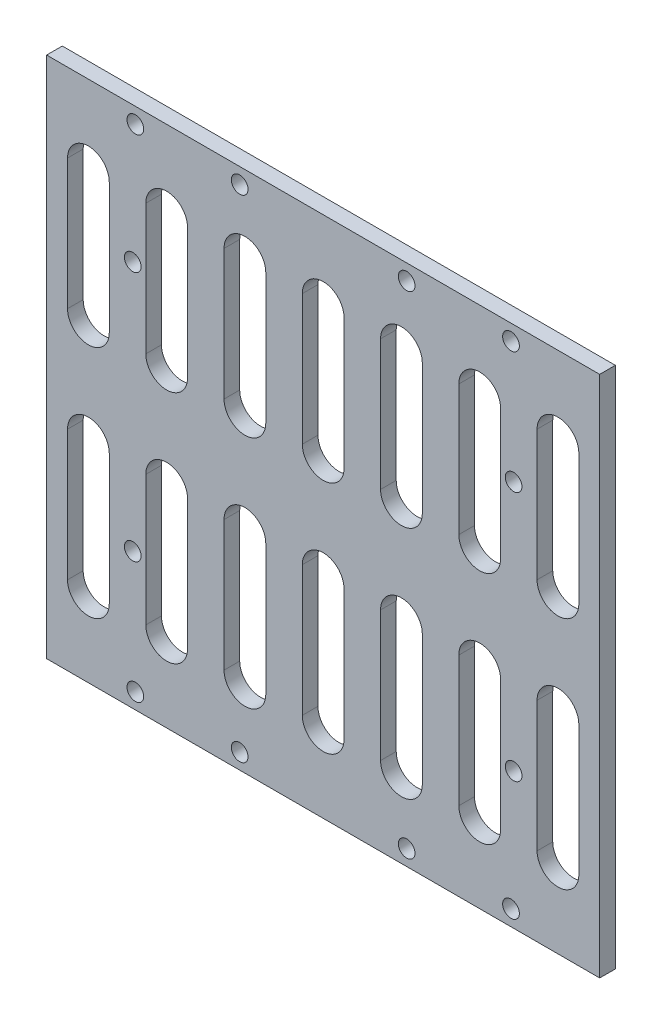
ISO-10303-21;
HEADER;
FILE_DESCRIPTION(('STEP AP214'),'2;1');
FILE_NAME('part.step','',(''),(''),'','','');
FILE_SCHEMA(('AUTOMOTIVE_DESIGN { 1 0 10303 214 1 1 1 1 }'));
ENDSEC;
DATA;
#1=APPLICATION_CONTEXT('core data for automotive mechanical design processes');
#2=APPLICATION_PROTOCOL_DEFINITION('international standard','automotive_design',2000,#1);
#3=PRODUCT_CONTEXT('',#1,'mechanical');
#4=PRODUCT('Part','Part','',(#3));
#5=PRODUCT_RELATED_PRODUCT_CATEGORY('part','',(#4));
#6=PRODUCT_DEFINITION_FORMATION('','',#4);
#7=PRODUCT_DEFINITION_CONTEXT('part definition',#1,'design');
#8=PRODUCT_DEFINITION('design','',#6,#7);
#9=PRODUCT_DEFINITION_SHAPE('','',#8);
#10=(LENGTH_UNIT() NAMED_UNIT(*) SI_UNIT(.MILLI.,.METRE.));
#11=(NAMED_UNIT(*) PLANE_ANGLE_UNIT() SI_UNIT($,.RADIAN.));
#12=(NAMED_UNIT(*) SI_UNIT($,.STERADIAN.) SOLID_ANGLE_UNIT());
#13=UNCERTAINTY_MEASURE_WITH_UNIT(LENGTH_MEASURE(1.E-05),#10,'distance_accuracy_value','');
#14=(GEOMETRIC_REPRESENTATION_CONTEXT(3) GLOBAL_UNCERTAINTY_ASSIGNED_CONTEXT((#13)) GLOBAL_UNIT_ASSIGNED_CONTEXT((#10,
#11,#12)) REPRESENTATION_CONTEXT('',''));
#15=CARTESIAN_POINT('',(0.,0.,0.));
#16=DIRECTION('',(0.,0.,1.));
#17=DIRECTION('',(1.,0.,0.));
#18=AXIS2_PLACEMENT_3D('',#15,#16,#17);
#19=CARTESIAN_POINT('',(-4.,35.,0.));
#20=DIRECTION('',(-1.,0.,0.));
#21=DIRECTION('',(0.,0.,1.));
#22=AXIS2_PLACEMENT_3D('',#19,#20,#21);
#23=PLANE('',#22);
#24=DIRECTION('',(0.,-1.,0.));
#25=VECTOR('',#24,1.);
#26=CARTESIAN_POINT('',(-4.,35.,3.));
#27=LINE('',#26,#25);
#28=CARTESIAN_POINT('',(-4.,35.,3.));
#29=VERTEX_POINT('',#28);
#30=CARTESIAN_POINT('',(-4.,10.,3.));
#31=VERTEX_POINT('',#30);
#32=EDGE_CURVE('E542',#29,#31,#27,.T.);
#33=ORIENTED_EDGE('',*,*,#32,.T.);
#34=DIRECTION('',(0.,0.,1.));
#35=VECTOR('',#34,1.);
#36=CARTESIAN_POINT('',(-4.,10.,0.));
#37=LINE('',#36,#35);
#38=CARTESIAN_POINT('',(-4.,10.,0.));
#39=VERTEX_POINT('',#38);
#40=EDGE_CURVE('E11',#39,#31,#37,.T.);
#41=ORIENTED_EDGE('',*,*,#40,.F.);
#42=DIRECTION('',(0.,-1.,0.));
#43=VECTOR('',#42,1.);
#44=CARTESIAN_POINT('',(-4.,35.,0.));
#45=LINE('',#44,#43);
#46=CARTESIAN_POINT('',(-4.,35.,0.));
#47=VERTEX_POINT('',#46);
#48=EDGE_CURVE('E727',#47,#39,#45,.T.);
#49=ORIENTED_EDGE('',*,*,#48,.F.);
#50=DIRECTION('',(0.,0.,1.));
#51=VECTOR('',#50,1.);
#52=CARTESIAN_POINT('',(-4.,35.,0.));
#53=LINE('',#52,#51);
#54=EDGE_CURVE('E1041',#47,#29,#53,.T.);
#55=ORIENTED_EDGE('',*,*,#54,.T.);
#56=EDGE_LOOP('',(#33,#41,#49,#55));
#57=FACE_BOUND('',#56,.T.);
#58=ADVANCED_FACE('F17',(#57),#23,.F.);
#59=CARTESIAN_POINT('',(0.,10.,0.));
#60=DIRECTION('',(0.,0.,1.));
#61=DIRECTION('',(1.,0.,0.));
#62=AXIS2_PLACEMENT_3D('',#59,#60,#61);
#63=CYLINDRICAL_SURFACE('',#62,4.);
#64=CARTESIAN_POINT('',(0.,10.,3.));
#65=DIRECTION('',(0.,0.,1.));
#66=DIRECTION('',(1.,0.,0.));
#67=AXIS2_PLACEMENT_3D('',#64,#65,#66);
#68=CIRCLE('',#67,4.);
#69=CARTESIAN_POINT('',(4.,10.,3.));
#70=VERTEX_POINT('',#69);
#71=EDGE_CURVE('E537',#31,#70,#68,.T.);
#72=ORIENTED_EDGE('',*,*,#71,.T.);
#73=DIRECTION('',(0.,0.,1.));
#74=VECTOR('',#73,1.);
#75=CARTESIAN_POINT('',(4.,10.,0.));
#76=LINE('',#75,#74);
#77=CARTESIAN_POINT('',(4.,10.,0.));
#78=VERTEX_POINT('',#77);
#79=EDGE_CURVE('E26',#78,#70,#76,.T.);
#80=ORIENTED_EDGE('',*,*,#79,.F.);
#81=CARTESIAN_POINT('',(0.,10.,0.));
#82=DIRECTION('',(0.,0.,1.));
#83=DIRECTION('',(1.,0.,0.));
#84=AXIS2_PLACEMENT_3D('',#81,#82,#83);
#85=CIRCLE('',#84,4.);
#86=EDGE_CURVE('E755',#39,#78,#85,.T.);
#87=ORIENTED_EDGE('',*,*,#86,.F.);
#88=ORIENTED_EDGE('',*,*,#40,.T.);
#89=EDGE_LOOP('',(#72,#80,#87,#88));
#90=FACE_BOUND('',#89,.T.);
#91=ADVANCED_FACE('F19',(#90),#63,.F.);
#92=CARTESIAN_POINT('',(4.,35.,0.));
#93=DIRECTION('',(-1.,0.,0.));
#94=DIRECTION('',(0.,0.,1.));
#95=AXIS2_PLACEMENT_3D('',#92,#93,#94);
#96=PLANE('',#95);
#97=DIRECTION('',(0.,-1.,0.));
#98=VECTOR('',#97,1.);
#99=CARTESIAN_POINT('',(4.,35.,3.));
#100=LINE('',#99,#98);
#101=CARTESIAN_POINT('',(4.,35.,3.));
#102=VERTEX_POINT('',#101);
#103=EDGE_CURVE('E527',#102,#70,#100,.T.);
#104=ORIENTED_EDGE('',*,*,#103,.F.);
#105=DIRECTION('',(0.,0.,1.));
#106=VECTOR('',#105,1.);
#107=CARTESIAN_POINT('',(4.,35.,0.));
#108=LINE('',#107,#106);
#109=CARTESIAN_POINT('',(4.,35.,0.));
#110=VERTEX_POINT('',#109);
#111=EDGE_CURVE('E535',#110,#102,#108,.T.);
#112=ORIENTED_EDGE('',*,*,#111,.F.);
#113=DIRECTION('',(0.,-1.,0.));
#114=VECTOR('',#113,1.);
#115=CARTESIAN_POINT('',(4.,35.,0.));
#116=LINE('',#115,#114);
#117=EDGE_CURVE('E530',#110,#78,#116,.T.);
#118=ORIENTED_EDGE('',*,*,#117,.T.);
#119=ORIENTED_EDGE('',*,*,#79,.T.);
#120=EDGE_LOOP('',(#104,#112,#118,#119));
#121=FACE_BOUND('',#120,.T.);
#122=ADVANCED_FACE('F525',(#121),#96,.T.);
#123=CARTESIAN_POINT('',(0.,35.,0.));
#124=DIRECTION('',(0.,0.,1.));
#125=DIRECTION('',(1.,0.,0.));
#126=AXIS2_PLACEMENT_3D('',#123,#124,#125);
#127=CYLINDRICAL_SURFACE('',#126,4.);
#128=CARTESIAN_POINT('',(0.,35.,3.));
#129=DIRECTION('',(0.,0.,1.));
#130=DIRECTION('',(1.,0.,0.));
#131=AXIS2_PLACEMENT_3D('',#128,#129,#130);
#132=CIRCLE('',#131,4.);
#133=EDGE_CURVE('E547',#102,#29,#132,.T.);
#134=ORIENTED_EDGE('',*,*,#133,.T.);
#135=ORIENTED_EDGE('',*,*,#54,.F.);
#136=CARTESIAN_POINT('',(0.,35.,0.));
#137=DIRECTION('',(0.,0.,1.));
#138=DIRECTION('',(1.,0.,0.));
#139=AXIS2_PLACEMENT_3D('',#136,#137,#138);
#140=CIRCLE('',#139,4.);
#141=EDGE_CURVE('E723',#110,#47,#140,.T.);
#142=ORIENTED_EDGE('',*,*,#141,.F.);
#143=ORIENTED_EDGE('',*,*,#111,.T.);
#144=EDGE_LOOP('',(#134,#135,#142,#143));
#145=FACE_BOUND('',#144,.T.);
#146=ADVANCED_FACE('F1094',(#145),#127,.F.);
#147=CARTESIAN_POINT('',(11.,35.,0.));
#148=DIRECTION('',(-1.,0.,0.));
#149=DIRECTION('',(0.,0.,1.));
#150=AXIS2_PLACEMENT_3D('',#147,#148,#149);
#151=PLANE('',#150);
#152=DIRECTION('',(0.,-1.,0.));
#153=VECTOR('',#152,1.);
#154=CARTESIAN_POINT('',(11.,35.,3.));
#155=LINE('',#154,#153);
#156=CARTESIAN_POINT('',(11.,35.,3.));
#157=VERTEX_POINT('',#156);
#158=CARTESIAN_POINT('',(11.,10.,3.));
#159=VERTEX_POINT('',#158);
#160=EDGE_CURVE('E586',#157,#159,#155,.T.);
#161=ORIENTED_EDGE('',*,*,#160,.T.);
#162=DIRECTION('',(0.,0.,1.));
#163=VECTOR('',#162,1.);
#164=CARTESIAN_POINT('',(11.,10.,0.));
#165=LINE('',#164,#163);
#166=CARTESIAN_POINT('',(11.,10.,0.));
#167=VERTEX_POINT('',#166);
#168=EDGE_CURVE('E709',#167,#159,#165,.T.);
#169=ORIENTED_EDGE('',*,*,#168,.F.);
#170=DIRECTION('',(0.,-1.,0.));
#171=VECTOR('',#170,1.);
#172=CARTESIAN_POINT('',(11.,35.,0.));
#173=LINE('',#172,#171);
#174=CARTESIAN_POINT('',(11.,35.,0.));
#175=VERTEX_POINT('',#174);
#176=EDGE_CURVE('E764',#175,#167,#173,.T.);
#177=ORIENTED_EDGE('',*,*,#176,.F.);
#178=DIRECTION('',(0.,0.,1.));
#179=VECTOR('',#178,1.);
#180=CARTESIAN_POINT('',(11.,35.,0.));
#181=LINE('',#180,#179);
#182=EDGE_CURVE('E1020',#175,#157,#181,.T.);
#183=ORIENTED_EDGE('',*,*,#182,.T.);
#184=EDGE_LOOP('',(#161,#169,#177,#183));
#185=FACE_BOUND('',#184,.T.);
#186=ADVANCED_FACE('F1355',(#185),#151,.F.);
#187=CARTESIAN_POINT('',(15.,10.,0.));
#188=DIRECTION('',(0.,0.,1.));
#189=DIRECTION('',(1.,0.,0.));
#190=AXIS2_PLACEMENT_3D('',#187,#188,#189);
#191=CYLINDRICAL_SURFACE('',#190,4.);
#192=CARTESIAN_POINT('',(15.,10.,3.));
#193=DIRECTION('',(0.,0.,1.));
#194=DIRECTION('',(1.,0.,0.));
#195=AXIS2_PLACEMENT_3D('',#192,#193,#194);
#196=CIRCLE('',#195,4.);
#197=CARTESIAN_POINT('',(19.,10.,3.));
#198=VERTEX_POINT('',#197);
#199=EDGE_CURVE('E590',#159,#198,#196,.T.);
#200=ORIENTED_EDGE('',*,*,#199,.T.);
#201=DIRECTION('',(0.,0.,1.));
#202=VECTOR('',#201,1.);
#203=CARTESIAN_POINT('',(19.,10.,0.));
#204=LINE('',#203,#202);
#205=CARTESIAN_POINT('',(19.,10.,0.));
#206=VERTEX_POINT('',#205);
#207=EDGE_CURVE('E706',#206,#198,#204,.T.);
#208=ORIENTED_EDGE('',*,*,#207,.F.);
#209=CARTESIAN_POINT('',(15.,10.,0.));
#210=DIRECTION('',(0.,0.,1.));
#211=DIRECTION('',(1.,0.,0.));
#212=AXIS2_PLACEMENT_3D('',#209,#210,#211);
#213=CIRCLE('',#212,4.);
#214=EDGE_CURVE('E768',#167,#206,#213,.T.);
#215=ORIENTED_EDGE('',*,*,#214,.F.);
#216=ORIENTED_EDGE('',*,*,#168,.T.);
#217=EDGE_LOOP('',(#200,#208,#215,#216));
#218=FACE_BOUND('',#217,.T.);
#219=ADVANCED_FACE('F1353',(#218),#191,.F.);
#220=CARTESIAN_POINT('',(19.,35.,0.));
#221=DIRECTION('',(-1.,0.,0.));
#222=DIRECTION('',(0.,0.,1.));
#223=AXIS2_PLACEMENT_3D('',#220,#221,#222);
#224=PLANE('',#223);
#225=DIRECTION('',(0.,-1.,0.));
#226=VECTOR('',#225,1.);
#227=CARTESIAN_POINT('',(19.,35.,3.));
#228=LINE('',#227,#226);
#229=CARTESIAN_POINT('',(19.,35.,3.));
#230=VERTEX_POINT('',#229);
#231=EDGE_CURVE('E580',#230,#198,#228,.T.);
#232=ORIENTED_EDGE('',*,*,#231,.F.);
#233=DIRECTION('',(0.,0.,1.));
#234=VECTOR('',#233,1.);
#235=CARTESIAN_POINT('',(19.,35.,0.));
#236=LINE('',#235,#234);
#237=CARTESIAN_POINT('',(19.,35.,0.));
#238=VERTEX_POINT('',#237);
#239=EDGE_CURVE('E710',#238,#230,#236,.T.);
#240=ORIENTED_EDGE('',*,*,#239,.F.);
#241=DIRECTION('',(0.,-1.,0.));
#242=VECTOR('',#241,1.);
#243=CARTESIAN_POINT('',(19.,35.,0.));
#244=LINE('',#243,#242);
#245=EDGE_CURVE('E756',#238,#206,#244,.T.);
#246=ORIENTED_EDGE('',*,*,#245,.T.);
#247=ORIENTED_EDGE('',*,*,#207,.T.);
#248=EDGE_LOOP('',(#232,#240,#246,#247));
#249=FACE_BOUND('',#248,.T.);
#250=ADVANCED_FACE('F1350',(#249),#224,.T.);
#251=CARTESIAN_POINT('',(15.,35.,0.));
#252=DIRECTION('',(0.,0.,1.));
#253=DIRECTION('',(1.,0.,0.));
#254=AXIS2_PLACEMENT_3D('',#251,#252,#253);
#255=CYLINDRICAL_SURFACE('',#254,4.);
#256=CARTESIAN_POINT('',(15.,35.,3.));
#257=DIRECTION('',(0.,0.,1.));
#258=DIRECTION('',(1.,0.,0.));
#259=AXIS2_PLACEMENT_3D('',#256,#257,#258);
#260=CIRCLE('',#259,4.);
#261=EDGE_CURVE('E566',#230,#157,#260,.T.);
#262=ORIENTED_EDGE('',*,*,#261,.T.);
#263=ORIENTED_EDGE('',*,*,#182,.F.);
#264=CARTESIAN_POINT('',(15.,35.,0.));
#265=DIRECTION('',(0.,0.,1.));
#266=DIRECTION('',(1.,0.,0.));
#267=AXIS2_PLACEMENT_3D('',#264,#265,#266);
#268=CIRCLE('',#267,4.);
#269=EDGE_CURVE('E760',#238,#175,#268,.T.);
#270=ORIENTED_EDGE('',*,*,#269,.F.);
#271=ORIENTED_EDGE('',*,*,#239,.T.);
#272=EDGE_LOOP('',(#262,#263,#270,#271));
#273=FACE_BOUND('',#272,.T.);
#274=ADVANCED_FACE('F1345',(#273),#255,.F.);
#275=CARTESIAN_POINT('',(19.,-35.,0.));
#276=DIRECTION('',(1.,0.,0.));
#277=DIRECTION('',(0.,-1.,0.));
#278=AXIS2_PLACEMENT_3D('',#275,#276,#277);
#279=PLANE('',#278);
#280=DIRECTION('',(0.,1.,0.));
#281=VECTOR('',#280,1.);
#282=CARTESIAN_POINT('',(19.,-35.,3.));
#283=LINE('',#282,#281);
#284=CARTESIAN_POINT('',(19.,-35.,3.));
#285=VERTEX_POINT('',#284);
#286=CARTESIAN_POINT('',(19.,-10.,3.));
#287=VERTEX_POINT('',#286);
#288=EDGE_CURVE('E739',#285,#287,#283,.T.);
#289=ORIENTED_EDGE('',*,*,#288,.T.);
#290=DIRECTION('',(0.,0.,1.));
#291=VECTOR('',#290,1.);
#292=CARTESIAN_POINT('',(19.,-10.,0.));
#293=LINE('',#292,#291);
#294=CARTESIAN_POINT('',(19.,-10.,0.));
#295=VERTEX_POINT('',#294);
#296=EDGE_CURVE('E50',#295,#287,#293,.T.);
#297=ORIENTED_EDGE('',*,*,#296,.F.);
#298=DIRECTION('',(0.,1.,0.));
#299=VECTOR('',#298,1.);
#300=CARTESIAN_POINT('',(19.,-35.,0.));
#301=LINE('',#300,#299);
#302=CARTESIAN_POINT('',(19.,-35.,0.));
#303=VERTEX_POINT('',#302);
#304=EDGE_CURVE('E951',#303,#295,#301,.T.);
#305=ORIENTED_EDGE('',*,*,#304,.F.);
#306=DIRECTION('',(0.,0.,1.));
#307=VECTOR('',#306,1.);
#308=CARTESIAN_POINT('',(19.,-35.,0.));
#309=LINE('',#308,#307);
#310=EDGE_CURVE('E570',#303,#285,#309,.T.);
#311=ORIENTED_EDGE('',*,*,#310,.T.);
#312=EDGE_LOOP('',(#289,#297,#305,#311));
#313=FACE_BOUND('',#312,.T.);
#314=ADVANCED_FACE('F1523',(#313),#279,.F.);
#315=CARTESIAN_POINT('',(15.,-10.,0.));
#316=DIRECTION('',(0.,0.,1.));
#317=DIRECTION('',(1.,0.,0.));
#318=AXIS2_PLACEMENT_3D('',#315,#316,#317);
#319=CYLINDRICAL_SURFACE('',#318,4.);
#320=CARTESIAN_POINT('',(15.,-10.,3.));
#321=DIRECTION('',(0.,0.,-1.));
#322=DIRECTION('',(-1.,0.,0.));
#323=AXIS2_PLACEMENT_3D('',#320,#321,#322);
#324=CIRCLE('',#323,4.);
#325=CARTESIAN_POINT('',(11.,-10.,3.));
#326=VERTEX_POINT('',#325);
#327=EDGE_CURVE('E651',#326,#287,#324,.T.);
#328=ORIENTED_EDGE('',*,*,#327,.F.);
#329=DIRECTION('',(0.,0.,1.));
#330=VECTOR('',#329,1.);
#331=CARTESIAN_POINT('',(11.,-10.,0.));
#332=LINE('',#331,#330);
#333=CARTESIAN_POINT('',(11.,-10.,0.));
#334=VERTEX_POINT('',#333);
#335=EDGE_CURVE('E39',#334,#326,#332,.T.);
#336=ORIENTED_EDGE('',*,*,#335,.F.);
#337=CARTESIAN_POINT('',(15.,-10.,0.));
#338=DIRECTION('',(0.,0.,-1.));
#339=DIRECTION('',(-1.,0.,0.));
#340=AXIS2_PLACEMENT_3D('',#337,#338,#339);
#341=CIRCLE('',#340,4.);
#342=EDGE_CURVE('E955',#334,#295,#341,.T.);
#343=ORIENTED_EDGE('',*,*,#342,.T.);
#344=ORIENTED_EDGE('',*,*,#296,.T.);
#345=EDGE_LOOP('',(#328,#336,#343,#344));
#346=FACE_BOUND('',#345,.T.);
#347=ADVANCED_FACE('F1519',(#346),#319,.F.);
#348=CARTESIAN_POINT('',(11.,-35.,0.));
#349=DIRECTION('',(1.,0.,0.));
#350=DIRECTION('',(0.,1.,0.));
#351=AXIS2_PLACEMENT_3D('',#348,#349,#350);
#352=PLANE('',#351);
#353=DIRECTION('',(0.,1.,0.));
#354=VECTOR('',#353,1.);
#355=CARTESIAN_POINT('',(11.,-35.,3.));
#356=LINE('',#355,#354);
#357=CARTESIAN_POINT('',(11.,-35.,3.));
#358=VERTEX_POINT('',#357);
#359=EDGE_CURVE('E647',#358,#326,#356,.T.);
#360=ORIENTED_EDGE('',*,*,#359,.F.);
#361=DIRECTION('',(0.,0.,1.));
#362=VECTOR('',#361,1.);
#363=CARTESIAN_POINT('',(11.,-35.,0.));
#364=LINE('',#363,#362);
#365=CARTESIAN_POINT('',(11.,-35.,0.));
#366=VERTEX_POINT('',#365);
#367=EDGE_CURVE('E567',#366,#358,#364,.T.);
#368=ORIENTED_EDGE('',*,*,#367,.F.);
#369=DIRECTION('',(0.,1.,0.));
#370=VECTOR('',#369,1.);
#371=CARTESIAN_POINT('',(11.,-35.,0.));
#372=LINE('',#371,#370);
#373=EDGE_CURVE('E958',#366,#334,#372,.T.);
#374=ORIENTED_EDGE('',*,*,#373,.T.);
#375=ORIENTED_EDGE('',*,*,#335,.T.);
#376=EDGE_LOOP('',(#360,#368,#374,#375));
#377=FACE_BOUND('',#376,.T.);
#378=ADVANCED_FACE('F1516',(#377),#352,.T.);
#379=CARTESIAN_POINT('',(15.,-35.,0.));
#380=DIRECTION('',(0.,0.,1.));
#381=DIRECTION('',(1.,0.,0.));
#382=AXIS2_PLACEMENT_3D('',#379,#380,#381);
#383=CYLINDRICAL_SURFACE('',#382,4.);
#384=CARTESIAN_POINT('',(15.,-35.,3.));
#385=DIRECTION('',(0.,0.,-1.));
#386=DIRECTION('',(-1.,0.,0.));
#387=AXIS2_PLACEMENT_3D('',#384,#385,#386);
#388=CIRCLE('',#387,4.);
#389=EDGE_CURVE('E652',#285,#358,#388,.T.);
#390=ORIENTED_EDGE('',*,*,#389,.F.);
#391=ORIENTED_EDGE('',*,*,#310,.F.);
#392=CARTESIAN_POINT('',(15.,-35.,0.));
#393=DIRECTION('',(0.,0.,-1.));
#394=DIRECTION('',(-1.,0.,0.));
#395=AXIS2_PLACEMENT_3D('',#392,#393,#394);
#396=CIRCLE('',#395,4.);
#397=EDGE_CURVE('E947',#303,#366,#396,.T.);
#398=ORIENTED_EDGE('',*,*,#397,.T.);
#399=ORIENTED_EDGE('',*,*,#367,.T.);
#400=EDGE_LOOP('',(#390,#391,#398,#399));
#401=FACE_BOUND('',#400,.T.);
#402=ADVANCED_FACE('F1508',(#401),#383,.F.);
#403=CARTESIAN_POINT('',(-11.,-35.,0.));
#404=DIRECTION('',(1.,0.,0.));
#405=DIRECTION('',(0.,-1.,0.));
#406=AXIS2_PLACEMENT_3D('',#403,#404,#405);
#407=PLANE('',#406);
#408=DIRECTION('',(0.,1.,0.));
#409=VECTOR('',#408,1.);
#410=CARTESIAN_POINT('',(-11.,-35.,3.));
#411=LINE('',#410,#409);
#412=CARTESIAN_POINT('',(-11.,-35.,3.));
#413=VERTEX_POINT('',#412);
#414=CARTESIAN_POINT('',(-11.,-10.,3.));
#415=VERTEX_POINT('',#414);
#416=EDGE_CURVE('E591',#413,#415,#411,.T.);
#417=ORIENTED_EDGE('',*,*,#416,.T.);
#418=DIRECTION('',(0.,0.,1.));
#419=VECTOR('',#418,1.);
#420=CARTESIAN_POINT('',(-11.,-10.,0.));
#421=LINE('',#420,#419);
#422=CARTESIAN_POINT('',(-11.,-10.,0.));
#423=VERTEX_POINT('',#422);
#424=EDGE_CURVE('E1078',#423,#415,#421,.T.);
#425=ORIENTED_EDGE('',*,*,#424,.F.);
#426=DIRECTION('',(0.,1.,0.));
#427=VECTOR('',#426,1.);
#428=CARTESIAN_POINT('',(-11.,-35.,0.));
#429=LINE('',#428,#427);
#430=CARTESIAN_POINT('',(-11.,-35.,0.));
#431=VERTEX_POINT('',#430);
#432=EDGE_CURVE('E934',#431,#423,#429,.T.);
#433=ORIENTED_EDGE('',*,*,#432,.F.);
#434=DIRECTION('',(0.,0.,1.));
#435=VECTOR('',#434,1.);
#436=CARTESIAN_POINT('',(-11.,-35.,0.));
#437=LINE('',#436,#435);
#438=EDGE_CURVE('E1071',#431,#413,#437,.T.);
#439=ORIENTED_EDGE('',*,*,#438,.T.);
#440=EDGE_LOOP('',(#417,#425,#433,#439));
#441=FACE_BOUND('',#440,.T.);
#442=ADVANCED_FACE('F1505',(#441),#407,.F.);
#443=CARTESIAN_POINT('',(-15.,-10.,0.));
#444=DIRECTION('',(0.,0.,1.));
#445=DIRECTION('',(1.,0.,0.));
#446=AXIS2_PLACEMENT_3D('',#443,#444,#445);
#447=CYLINDRICAL_SURFACE('',#446,4.);
#448=CARTESIAN_POINT('',(-15.,-10.,3.));
#449=DIRECTION('',(0.,0.,1.));
#450=DIRECTION('',(1.,0.,0.));
#451=AXIS2_PLACEMENT_3D('',#448,#449,#450);
#452=CIRCLE('',#451,4.);
#453=CARTESIAN_POINT('',(-19.,-10.,3.));
#454=VERTEX_POINT('',#453);
#455=EDGE_CURVE('E575',#415,#454,#452,.T.);
#456=ORIENTED_EDGE('',*,*,#455,.T.);
#457=DIRECTION('',(0.,0.,1.));
#458=VECTOR('',#457,1.);
#459=CARTESIAN_POINT('',(-19.,-10.,0.));
#460=LINE('',#459,#458);
#461=CARTESIAN_POINT('',(-19.,-10.,0.));
#462=VERTEX_POINT('',#461);
#463=EDGE_CURVE('E1077',#462,#454,#460,.T.);
#464=ORIENTED_EDGE('',*,*,#463,.F.);
#465=CARTESIAN_POINT('',(-15.,-10.,0.));
#466=DIRECTION('',(0.,0.,1.));
#467=DIRECTION('',(1.,0.,0.));
#468=AXIS2_PLACEMENT_3D('',#465,#466,#467);
#469=CIRCLE('',#468,4.);
#470=EDGE_CURVE('E941',#423,#462,#469,.T.);
#471=ORIENTED_EDGE('',*,*,#470,.F.);
#472=ORIENTED_EDGE('',*,*,#424,.T.);
#473=EDGE_LOOP('',(#456,#464,#471,#472));
#474=FACE_BOUND('',#473,.T.);
#475=ADVANCED_FACE('F1451',(#474),#447,.F.);
#476=CARTESIAN_POINT('',(-19.,-35.,0.));
#477=DIRECTION('',(1.,0.,0.));
#478=DIRECTION('',(0.,1.,0.));
#479=AXIS2_PLACEMENT_3D('',#476,#477,#478);
#480=PLANE('',#479);
#481=DIRECTION('',(0.,1.,0.));
#482=VECTOR('',#481,1.);
#483=CARTESIAN_POINT('',(-19.,-35.,3.));
#484=LINE('',#483,#482);
#485=CARTESIAN_POINT('',(-19.,-35.,3.));
#486=VERTEX_POINT('',#485);
#487=EDGE_CURVE('E571',#486,#454,#484,.T.);
#488=ORIENTED_EDGE('',*,*,#487,.F.);
#489=DIRECTION('',(0.,0.,1.));
#490=VECTOR('',#489,1.);
#491=CARTESIAN_POINT('',(-19.,-35.,0.));
#492=LINE('',#491,#490);
#493=CARTESIAN_POINT('',(-19.,-35.,0.));
#494=VERTEX_POINT('',#493);
#495=EDGE_CURVE('E1074',#494,#486,#492,.T.);
#496=ORIENTED_EDGE('',*,*,#495,.F.);
#497=DIRECTION('',(0.,1.,0.));
#498=VECTOR('',#497,1.);
#499=CARTESIAN_POINT('',(-19.,-35.,0.));
#500=LINE('',#499,#498);
#501=EDGE_CURVE('E926',#494,#462,#500,.T.);
#502=ORIENTED_EDGE('',*,*,#501,.T.);
#503=ORIENTED_EDGE('',*,*,#463,.T.);
#504=EDGE_LOOP('',(#488,#496,#502,#503));
#505=FACE_BOUND('',#504,.T.);
#506=ADVANCED_FACE('F1447',(#505),#480,.T.);
#507=CARTESIAN_POINT('',(-15.,-35.,0.));
#508=DIRECTION('',(0.,0.,1.));
#509=DIRECTION('',(1.,0.,0.));
#510=AXIS2_PLACEMENT_3D('',#507,#508,#509);
#511=CYLINDRICAL_SURFACE('',#510,4.);
#512=CARTESIAN_POINT('',(-15.,-35.,3.));
#513=DIRECTION('',(0.,0.,1.));
#514=DIRECTION('',(1.,0.,0.));
#515=AXIS2_PLACEMENT_3D('',#512,#513,#514);
#516=CIRCLE('',#515,4.);
#517=EDGE_CURVE('E576',#486,#413,#516,.T.);
#518=ORIENTED_EDGE('',*,*,#517,.T.);
#519=ORIENTED_EDGE('',*,*,#438,.F.);
#520=CARTESIAN_POINT('',(-15.,-35.,0.));
#521=DIRECTION('',(0.,0.,1.));
#522=DIRECTION('',(1.,0.,0.));
#523=AXIS2_PLACEMENT_3D('',#520,#521,#522);
#524=CIRCLE('',#523,4.);
#525=EDGE_CURVE('E930',#494,#431,#524,.T.);
#526=ORIENTED_EDGE('',*,*,#525,.F.);
#527=ORIENTED_EDGE('',*,*,#495,.T.);
#528=EDGE_LOOP('',(#518,#519,#526,#527));
#529=FACE_BOUND('',#528,.T.);
#530=ADVANCED_FACE('F1450',(#529),#511,.F.);
#531=CARTESIAN_POINT('',(-41.,-35.,0.));
#532=DIRECTION('',(1.,0.,0.));
#533=DIRECTION('',(0.,1.,0.));
#534=AXIS2_PLACEMENT_3D('',#531,#532,#533);
#535=PLANE('',#534);
#536=DIRECTION('',(0.,1.,0.));
#537=VECTOR('',#536,1.);
#538=CARTESIAN_POINT('',(-41.,-35.,3.));
#539=LINE('',#538,#537);
#540=CARTESIAN_POINT('',(-41.,-35.,3.));
#541=VERTEX_POINT('',#540);
#542=CARTESIAN_POINT('',(-41.,-10.,3.));
#543=VERTEX_POINT('',#542);
#544=EDGE_CURVE('E1157',#541,#543,#539,.T.);
#545=ORIENTED_EDGE('',*,*,#544,.T.);
#546=DIRECTION('',(0.,0.,1.));
#547=VECTOR('',#546,1.);
#548=CARTESIAN_POINT('',(-41.,-10.,0.));
#549=LINE('',#548,#547);
#550=CARTESIAN_POINT('',(-41.,-10.,0.));
#551=VERTEX_POINT('',#550);
#552=EDGE_CURVE('E1068',#551,#543,#549,.T.);
#553=ORIENTED_EDGE('',*,*,#552,.F.);
#554=DIRECTION('',(0.,1.,0.));
#555=VECTOR('',#554,1.);
#556=CARTESIAN_POINT('',(-41.,-35.,0.));
#557=LINE('',#556,#555);
#558=CARTESIAN_POINT('',(-41.,-35.,0.));
#559=VERTEX_POINT('',#558);
#560=EDGE_CURVE('E918',#559,#551,#557,.T.);
#561=ORIENTED_EDGE('',*,*,#560,.F.);
#562=DIRECTION('',(0.,0.,1.));
#563=VECTOR('',#562,1.);
#564=CARTESIAN_POINT('',(-41.,-35.,0.));
#565=LINE('',#564,#563);
#566=EDGE_CURVE('E1059',#559,#541,#565,.T.);
#567=ORIENTED_EDGE('',*,*,#566,.T.);
#568=EDGE_LOOP('',(#545,#553,#561,#567));
#569=FACE_BOUND('',#568,.T.);
#570=ADVANCED_FACE('F1494',(#569),#535,.F.);
#571=CARTESIAN_POINT('',(-45.,-10.,0.));
#572=DIRECTION('',(0.,0.,1.));
#573=DIRECTION('',(1.,0.,0.));
#574=AXIS2_PLACEMENT_3D('',#571,#572,#573);
#575=CYLINDRICAL_SURFACE('',#574,4.);
#576=CARTESIAN_POINT('',(-45.,-10.,3.));
#577=DIRECTION('',(0.,0.,1.));
#578=DIRECTION('',(1.,0.,0.));
#579=AXIS2_PLACEMENT_3D('',#576,#577,#578);
#580=CIRCLE('',#579,4.);
#581=CARTESIAN_POINT('',(-49.,-10.,3.));
#582=VERTEX_POINT('',#581);
#583=EDGE_CURVE('E603',#543,#582,#580,.T.);
#584=ORIENTED_EDGE('',*,*,#583,.T.);
#585=DIRECTION('',(0.,0.,1.));
#586=VECTOR('',#585,1.);
#587=CARTESIAN_POINT('',(-49.,-10.,0.));
#588=LINE('',#587,#586);
#589=CARTESIAN_POINT('',(-49.,-10.,0.));
#590=VERTEX_POINT('',#589);
#591=EDGE_CURVE('E1065',#590,#582,#588,.T.);
#592=ORIENTED_EDGE('',*,*,#591,.F.);
#593=CARTESIAN_POINT('',(-45.,-10.,0.));
#594=DIRECTION('',(0.,0.,1.));
#595=DIRECTION('',(1.,0.,0.));
#596=AXIS2_PLACEMENT_3D('',#593,#594,#595);
#597=CIRCLE('',#596,4.);
#598=EDGE_CURVE('E922',#551,#590,#597,.T.);
#599=ORIENTED_EDGE('',*,*,#598,.F.);
#600=ORIENTED_EDGE('',*,*,#552,.T.);
#601=EDGE_LOOP('',(#584,#592,#599,#600));
#602=FACE_BOUND('',#601,.T.);
#603=ADVANCED_FACE('F1497',(#602),#575,.F.);
#604=CARTESIAN_POINT('',(-49.,-35.,0.));
#605=DIRECTION('',(1.,0.,0.));
#606=DIRECTION('',(0.,1.,0.));
#607=AXIS2_PLACEMENT_3D('',#604,#605,#606);
#608=PLANE('',#607);
#609=DIRECTION('',(0.,1.,0.));
#610=VECTOR('',#609,1.);
#611=CARTESIAN_POINT('',(-49.,-35.,3.));
#612=LINE('',#611,#610);
#613=CARTESIAN_POINT('',(-49.,-35.,3.));
#614=VERTEX_POINT('',#613);
#615=EDGE_CURVE('E599',#614,#582,#612,.T.);
#616=ORIENTED_EDGE('',*,*,#615,.F.);
#617=DIRECTION('',(0.,0.,1.));
#618=VECTOR('',#617,1.);
#619=CARTESIAN_POINT('',(-49.,-35.,0.));
#620=LINE('',#619,#618);
#621=CARTESIAN_POINT('',(-49.,-35.,0.));
#622=VERTEX_POINT('',#621);
#623=EDGE_CURVE('E1062',#622,#614,#620,.T.);
#624=ORIENTED_EDGE('',*,*,#623,.F.);
#625=DIRECTION('',(0.,1.,0.));
#626=VECTOR('',#625,1.);
#627=CARTESIAN_POINT('',(-49.,-35.,0.));
#628=LINE('',#627,#626);
#629=EDGE_CURVE('E910',#622,#590,#628,.T.);
#630=ORIENTED_EDGE('',*,*,#629,.T.);
#631=ORIENTED_EDGE('',*,*,#591,.T.);
#632=EDGE_LOOP('',(#616,#624,#630,#631));
#633=FACE_BOUND('',#632,.T.);
#634=ADVANCED_FACE('F1474',(#633),#608,.T.);
#635=CARTESIAN_POINT('',(-45.,-35.,0.));
#636=DIRECTION('',(0.,0.,1.));
#637=DIRECTION('',(1.,0.,0.));
#638=AXIS2_PLACEMENT_3D('',#635,#636,#637);
#639=CYLINDRICAL_SURFACE('',#638,4.);
#640=CARTESIAN_POINT('',(-45.,-35.,3.));
#641=DIRECTION('',(0.,0.,1.));
#642=DIRECTION('',(1.,0.,0.));
#643=AXIS2_PLACEMENT_3D('',#640,#641,#642);
#644=CIRCLE('',#643,4.);
#645=EDGE_CURVE('E595',#614,#541,#644,.T.);
#646=ORIENTED_EDGE('',*,*,#645,.T.);
#647=ORIENTED_EDGE('',*,*,#566,.F.);
#648=CARTESIAN_POINT('',(-45.,-35.,0.));
#649=DIRECTION('',(0.,0.,1.));
#650=DIRECTION('',(1.,0.,0.));
#651=AXIS2_PLACEMENT_3D('',#648,#649,#650);
#652=CIRCLE('',#651,4.);
#653=EDGE_CURVE('E914',#622,#559,#652,.T.);
#654=ORIENTED_EDGE('',*,*,#653,.F.);
#655=ORIENTED_EDGE('',*,*,#623,.T.);
#656=EDGE_LOOP('',(#646,#647,#654,#655));
#657=FACE_BOUND('',#656,.T.);
#658=ADVANCED_FACE('F1470',(#657),#639,.F.);
#659=CARTESIAN_POINT('',(-34.,35.,0.));
#660=DIRECTION('',(-1.,0.,0.));
#661=DIRECTION('',(0.,0.,1.));
#662=AXIS2_PLACEMENT_3D('',#659,#660,#661);
#663=PLANE('',#662);
#664=DIRECTION('',(0.,-1.,0.));
#665=VECTOR('',#664,1.);
#666=CARTESIAN_POINT('',(-34.,35.,3.));
#667=LINE('',#666,#665);
#668=CARTESIAN_POINT('',(-34.,35.,3.));
#669=VERTEX_POINT('',#668);
#670=CARTESIAN_POINT('',(-34.,10.,3.));
#671=VERTEX_POINT('',#670);
#672=EDGE_CURVE('E616',#669,#671,#667,.T.);
#673=ORIENTED_EDGE('',*,*,#672,.T.);
#674=DIRECTION('',(0.,0.,1.));
#675=VECTOR('',#674,1.);
#676=CARTESIAN_POINT('',(-34.,10.,0.));
#677=LINE('',#676,#675);
#678=CARTESIAN_POINT('',(-34.,10.,0.));
#679=VERTEX_POINT('',#678);
#680=EDGE_CURVE('E1058',#679,#671,#677,.T.);
#681=ORIENTED_EDGE('',*,*,#680,.F.);
#682=DIRECTION('',(0.,-1.,0.));
#683=VECTOR('',#682,1.);
#684=CARTESIAN_POINT('',(-34.,35.,0.));
#685=LINE('',#684,#683);
#686=CARTESIAN_POINT('',(-34.,35.,0.));
#687=VERTEX_POINT('',#686);
#688=EDGE_CURVE('E776',#687,#679,#685,.T.);
#689=ORIENTED_EDGE('',*,*,#688,.F.);
#690=DIRECTION('',(0.,0.,1.));
#691=VECTOR('',#690,1.);
#692=CARTESIAN_POINT('',(-34.,35.,0.));
#693=LINE('',#692,#691);
#694=EDGE_CURVE('E1049',#687,#669,#693,.T.);
#695=ORIENTED_EDGE('',*,*,#694,.T.);
#696=EDGE_LOOP('',(#673,#681,#689,#695));
#697=FACE_BOUND('',#696,.T.);
#698=ADVANCED_FACE('F1473',(#697),#663,.F.);
#699=CARTESIAN_POINT('',(-30.,10.,0.));
#700=DIRECTION('',(0.,0.,1.));
#701=DIRECTION('',(1.,0.,0.));
#702=AXIS2_PLACEMENT_3D('',#699,#700,#701);
#703=CYLINDRICAL_SURFACE('',#702,4.);
#704=CARTESIAN_POINT('',(-30.,10.,3.));
#705=DIRECTION('',(0.,0.,-1.));
#706=DIRECTION('',(-1.,0.,0.));
#707=AXIS2_PLACEMENT_3D('',#704,#705,#706);
#708=CIRCLE('',#707,4.);
#709=CARTESIAN_POINT('',(-26.,10.,3.));
#710=VERTEX_POINT('',#709);
#711=EDGE_CURVE('E735',#710,#671,#708,.T.);
#712=ORIENTED_EDGE('',*,*,#711,.F.);
#713=DIRECTION('',(0.,0.,1.));
#714=VECTOR('',#713,1.);
#715=CARTESIAN_POINT('',(-26.,10.,0.));
#716=LINE('',#715,#714);
#717=CARTESIAN_POINT('',(-26.,10.,0.));
#718=VERTEX_POINT('',#717);
#719=EDGE_CURVE('E1055',#718,#710,#716,.T.);
#720=ORIENTED_EDGE('',*,*,#719,.F.);
#721=CARTESIAN_POINT('',(-30.,10.,0.));
#722=DIRECTION('',(0.,0.,-1.));
#723=DIRECTION('',(-1.,0.,0.));
#724=AXIS2_PLACEMENT_3D('',#721,#722,#723);
#725=CIRCLE('',#724,4.);
#726=EDGE_CURVE('E780',#718,#679,#725,.T.);
#727=ORIENTED_EDGE('',*,*,#726,.T.);
#728=ORIENTED_EDGE('',*,*,#680,.T.);
#729=EDGE_LOOP('',(#712,#720,#727,#728));
#730=FACE_BOUND('',#729,.T.);
#731=ADVANCED_FACE('F1489',(#730),#703,.F.);
#732=CARTESIAN_POINT('',(-26.,35.,0.));
#733=DIRECTION('',(-1.,0.,0.));
#734=DIRECTION('',(0.,1.,0.));
#735=AXIS2_PLACEMENT_3D('',#732,#733,#734);
#736=PLANE('',#735);
#737=DIRECTION('',(0.,-1.,0.));
#738=VECTOR('',#737,1.);
#739=CARTESIAN_POINT('',(-26.,35.,3.));
#740=LINE('',#739,#738);
#741=CARTESIAN_POINT('',(-26.,35.,3.));
#742=VERTEX_POINT('',#741);
#743=EDGE_CURVE('E740',#742,#710,#740,.T.);
#744=ORIENTED_EDGE('',*,*,#743,.F.);
#745=DIRECTION('',(0.,0.,1.));
#746=VECTOR('',#745,1.);
#747=CARTESIAN_POINT('',(-26.,35.,0.));
#748=LINE('',#747,#746);
#749=CARTESIAN_POINT('',(-26.,35.,0.));
#750=VERTEX_POINT('',#749);
#751=EDGE_CURVE('E1052',#750,#742,#748,.T.);
#752=ORIENTED_EDGE('',*,*,#751,.F.);
#753=DIRECTION('',(0.,-1.,0.));
#754=VECTOR('',#753,1.);
#755=CARTESIAN_POINT('',(-26.,35.,0.));
#756=LINE('',#755,#754);
#757=EDGE_CURVE('E784',#750,#718,#756,.T.);
#758=ORIENTED_EDGE('',*,*,#757,.T.);
#759=ORIENTED_EDGE('',*,*,#719,.T.);
#760=EDGE_LOOP('',(#744,#752,#758,#759));
#761=FACE_BOUND('',#760,.T.);
#762=ADVANCED_FACE('F1492',(#761),#736,.T.);
#763=CARTESIAN_POINT('',(-30.,35.,0.));
#764=DIRECTION('',(0.,0.,1.));
#765=DIRECTION('',(1.,0.,0.));
#766=AXIS2_PLACEMENT_3D('',#763,#764,#765);
#767=CYLINDRICAL_SURFACE('',#766,4.);
#768=CARTESIAN_POINT('',(-30.,35.,3.));
#769=DIRECTION('',(0.,0.,-1.));
#770=DIRECTION('',(-1.,0.,0.));
#771=AXIS2_PLACEMENT_3D('',#768,#769,#770);
#772=CIRCLE('',#771,4.);
#773=EDGE_CURVE('E620',#669,#742,#772,.T.);
#774=ORIENTED_EDGE('',*,*,#773,.F.);
#775=ORIENTED_EDGE('',*,*,#694,.F.);
#776=CARTESIAN_POINT('',(-30.,35.,0.));
#777=DIRECTION('',(0.,0.,-1.));
#778=DIRECTION('',(-1.,0.,0.));
#779=AXIS2_PLACEMENT_3D('',#776,#777,#778);
#780=CIRCLE('',#779,4.);
#781=EDGE_CURVE('E772',#687,#750,#780,.T.);
#782=ORIENTED_EDGE('',*,*,#781,.T.);
#783=ORIENTED_EDGE('',*,*,#751,.T.);
#784=EDGE_LOOP('',(#774,#775,#782,#783));
#785=FACE_BOUND('',#784,.T.);
#786=ADVANCED_FACE('F1487',(#785),#767,.F.);
#787=CARTESIAN_POINT('',(-26.,-35.,0.));
#788=DIRECTION('',(1.,0.,0.));
#789=DIRECTION('',(0.,-1.,0.));
#790=AXIS2_PLACEMENT_3D('',#787,#788,#789);
#791=PLANE('',#790);
#792=DIRECTION('',(0.,1.,0.));
#793=VECTOR('',#792,1.);
#794=CARTESIAN_POINT('',(-26.,-35.,3.));
#795=LINE('',#794,#793);
#796=CARTESIAN_POINT('',(-26.,-35.,3.));
#797=VERTEX_POINT('',#796);
#798=CARTESIAN_POINT('',(-26.,-10.,3.));
#799=VERTEX_POINT('',#798);
#800=EDGE_CURVE('E625',#797,#799,#795,.T.);
#801=ORIENTED_EDGE('',*,*,#800,.T.);
#802=DIRECTION('',(0.,0.,1.));
#803=VECTOR('',#802,1.);
#804=CARTESIAN_POINT('',(-26.,-10.,0.));
#805=LINE('',#804,#803);
#806=CARTESIAN_POINT('',(-26.,-10.,0.));
#807=VERTEX_POINT('',#806);
#808=EDGE_CURVE('E1046',#807,#799,#805,.T.);
#809=ORIENTED_EDGE('',*,*,#808,.F.);
#810=DIRECTION('',(0.,1.,0.));
#811=VECTOR('',#810,1.);
#812=CARTESIAN_POINT('',(-26.,-35.,0.));
#813=LINE('',#812,#811);
#814=CARTESIAN_POINT('',(-26.,-35.,0.));
#815=VERTEX_POINT('',#814);
#816=EDGE_CURVE('E796',#815,#807,#813,.T.);
#817=ORIENTED_EDGE('',*,*,#816,.F.);
#818=DIRECTION('',(0.,0.,1.));
#819=VECTOR('',#818,1.);
#820=CARTESIAN_POINT('',(-26.,-35.,0.));
#821=LINE('',#820,#819);
#822=EDGE_CURVE('E584',#815,#797,#821,.T.);
#823=ORIENTED_EDGE('',*,*,#822,.T.);
#824=EDGE_LOOP('',(#801,#809,#817,#823));
#825=FACE_BOUND('',#824,.T.);
#826=ADVANCED_FACE('F1483',(#825),#791,.F.);
#827=CARTESIAN_POINT('',(-30.,-10.,0.));
#828=DIRECTION('',(0.,0.,1.));
#829=DIRECTION('',(1.,0.,0.));
#830=AXIS2_PLACEMENT_3D('',#827,#828,#829);
#831=CYLINDRICAL_SURFACE('',#830,4.);
#832=CARTESIAN_POINT('',(-30.,-10.,3.));
#833=DIRECTION('',(0.,0.,1.));
#834=DIRECTION('',(1.,0.,0.));
#835=AXIS2_PLACEMENT_3D('',#832,#833,#834);
#836=CIRCLE('',#835,4.);
#837=CARTESIAN_POINT('',(-34.,-10.,3.));
#838=VERTEX_POINT('',#837);
#839=EDGE_CURVE('E614',#799,#838,#836,.T.);
#840=ORIENTED_EDGE('',*,*,#839,.T.);
#841=DIRECTION('',(0.,0.,1.));
#842=VECTOR('',#841,1.);
#843=CARTESIAN_POINT('',(-34.,-10.,0.));
#844=LINE('',#843,#842);
#845=CARTESIAN_POINT('',(-34.,-10.,0.));
#846=VERTEX_POINT('',#845);
#847=EDGE_CURVE('E1040',#846,#838,#844,.T.);
#848=ORIENTED_EDGE('',*,*,#847,.F.);
#849=CARTESIAN_POINT('',(-30.,-10.,0.));
#850=DIRECTION('',(0.,0.,1.));
#851=DIRECTION('',(1.,0.,0.));
#852=AXIS2_PLACEMENT_3D('',#849,#850,#851);
#853=CIRCLE('',#852,4.);
#854=EDGE_CURVE('E800',#807,#846,#853,.T.);
#855=ORIENTED_EDGE('',*,*,#854,.F.);
#856=ORIENTED_EDGE('',*,*,#808,.T.);
#857=EDGE_LOOP('',(#840,#848,#855,#856));
#858=FACE_BOUND('',#857,.T.);
#859=ADVANCED_FACE('F1479',(#858),#831,.F.);
#860=CARTESIAN_POINT('',(-34.,-35.,0.));
#861=DIRECTION('',(1.,0.,0.));
#862=DIRECTION('',(0.,1.,0.));
#863=AXIS2_PLACEMENT_3D('',#860,#861,#862);
#864=PLANE('',#863);
#865=DIRECTION('',(0.,1.,0.));
#866=VECTOR('',#865,1.);
#867=CARTESIAN_POINT('',(-34.,-35.,3.));
#868=LINE('',#867,#866);
#869=CARTESIAN_POINT('',(-34.,-35.,3.));
#870=VERTEX_POINT('',#869);
#871=EDGE_CURVE('E610',#870,#838,#868,.T.);
#872=ORIENTED_EDGE('',*,*,#871,.F.);
#873=DIRECTION('',(0.,0.,1.));
#874=VECTOR('',#873,1.);
#875=CARTESIAN_POINT('',(-34.,-35.,0.));
#876=LINE('',#875,#874);
#877=CARTESIAN_POINT('',(-34.,-35.,0.));
#878=VERTEX_POINT('',#877);
#879=EDGE_CURVE('E1037',#878,#870,#876,.T.);
#880=ORIENTED_EDGE('',*,*,#879,.F.);
#881=DIRECTION('',(0.,1.,0.));
#882=VECTOR('',#881,1.);
#883=CARTESIAN_POINT('',(-34.,-35.,0.));
#884=LINE('',#883,#882);
#885=EDGE_CURVE('E788',#878,#846,#884,.T.);
#886=ORIENTED_EDGE('',*,*,#885,.T.);
#887=ORIENTED_EDGE('',*,*,#847,.T.);
#888=EDGE_LOOP('',(#872,#880,#886,#887));
#889=FACE_BOUND('',#888,.T.);
#890=ADVANCED_FACE('F1476',(#889),#864,.T.);
#891=CARTESIAN_POINT('',(-30.,-35.,0.));
#892=DIRECTION('',(0.,0.,1.));
#893=DIRECTION('',(1.,0.,0.));
#894=AXIS2_PLACEMENT_3D('',#891,#892,#893);
#895=CYLINDRICAL_SURFACE('',#894,4.);
#896=CARTESIAN_POINT('',(-30.,-35.,3.));
#897=DIRECTION('',(0.,0.,1.));
#898=DIRECTION('',(1.,0.,0.));
#899=AXIS2_PLACEMENT_3D('',#896,#897,#898);
#900=CIRCLE('',#899,4.);
#901=EDGE_CURVE('E615',#870,#797,#900,.T.);
#902=ORIENTED_EDGE('',*,*,#901,.T.);
#903=ORIENTED_EDGE('',*,*,#822,.F.);
#904=CARTESIAN_POINT('',(-30.,-35.,0.));
#905=DIRECTION('',(0.,0.,1.));
#906=DIRECTION('',(1.,0.,0.));
#907=AXIS2_PLACEMENT_3D('',#904,#905,#906);
#908=CIRCLE('',#907,4.);
#909=EDGE_CURVE('E792',#878,#815,#908,.T.);
#910=ORIENTED_EDGE('',*,*,#909,.F.);
#911=ORIENTED_EDGE('',*,*,#879,.T.);
#912=EDGE_LOOP('',(#902,#903,#910,#911));
#913=FACE_BOUND('',#912,.T.);
#914=ADVANCED_FACE('F1468',(#913),#895,.F.);
#915=CARTESIAN_POINT('',(-19.,35.,0.));
#916=DIRECTION('',(-1.,0.,0.));
#917=DIRECTION('',(0.,0.,1.));
#918=AXIS2_PLACEMENT_3D('',#915,#916,#917);
#919=PLANE('',#918);
#920=DIRECTION('',(0.,-1.,0.));
#921=VECTOR('',#920,1.);
#922=CARTESIAN_POINT('',(-19.,35.,3.));
#923=LINE('',#922,#921);
#924=CARTESIAN_POINT('',(-19.,35.,3.));
#925=VERTEX_POINT('',#924);
#926=CARTESIAN_POINT('',(-19.,10.,3.));
#927=VERTEX_POINT('',#926);
#928=EDGE_CURVE('E731',#925,#927,#923,.T.);
#929=ORIENTED_EDGE('',*,*,#928,.T.);
#930=DIRECTION('',(0.,0.,1.));
#931=VECTOR('',#930,1.);
#932=CARTESIAN_POINT('',(-19.,10.,0.));
#933=LINE('',#932,#931);
#934=CARTESIAN_POINT('',(-19.,10.,0.));
#935=VERTEX_POINT('',#934);
#936=EDGE_CURVE('E581',#935,#927,#933,.T.);
#937=ORIENTED_EDGE('',*,*,#936,.F.);
#938=DIRECTION('',(0.,-1.,0.));
#939=VECTOR('',#938,1.);
#940=CARTESIAN_POINT('',(-19.,35.,0.));
#941=LINE('',#940,#939);
#942=CARTESIAN_POINT('',(-19.,35.,0.));
#943=VERTEX_POINT('',#942);
#944=EDGE_CURVE('E901',#943,#935,#941,.T.);
#945=ORIENTED_EDGE('',*,*,#944,.F.);
#946=DIRECTION('',(0.,0.,1.));
#947=VECTOR('',#946,1.);
#948=CARTESIAN_POINT('',(-19.,35.,0.));
#949=LINE('',#948,#947);
#950=EDGE_CURVE('E694',#943,#925,#949,.T.);
#951=ORIENTED_EDGE('',*,*,#950,.T.);
#952=EDGE_LOOP('',(#929,#937,#945,#951));
#953=FACE_BOUND('',#952,.T.);
#954=ADVANCED_FACE('F1464',(#953),#919,.F.);
#955=CARTESIAN_POINT('',(-15.,10.,0.));
#956=DIRECTION('',(0.,0.,1.));
#957=DIRECTION('',(1.,0.,0.));
#958=AXIS2_PLACEMENT_3D('',#955,#956,#957);
#959=CYLINDRICAL_SURFACE('',#958,4.);
#960=CARTESIAN_POINT('',(-15.,10.,3.));
#961=DIRECTION('',(0.,0.,-1.));
#962=DIRECTION('',(-1.,0.,0.));
#963=AXIS2_PLACEMENT_3D('',#960,#961,#962);
#964=CIRCLE('',#963,4.);
#965=CARTESIAN_POINT('',(-11.,10.,3.));
#966=VERTEX_POINT('',#965);
#967=EDGE_CURVE('E621',#966,#927,#964,.T.);
#968=ORIENTED_EDGE('',*,*,#967,.F.);
#969=DIRECTION('',(0.,0.,1.));
#970=VECTOR('',#969,1.);
#971=CARTESIAN_POINT('',(-11.,10.,0.));
#972=LINE('',#971,#970);
#973=CARTESIAN_POINT('',(-11.,10.,0.));
#974=VERTEX_POINT('',#973);
#975=EDGE_CURVE('E585',#974,#966,#972,.T.);
#976=ORIENTED_EDGE('',*,*,#975,.F.);
#977=CARTESIAN_POINT('',(-15.,10.,0.));
#978=DIRECTION('',(0.,0.,-1.));
#979=DIRECTION('',(-1.,0.,0.));
#980=AXIS2_PLACEMENT_3D('',#977,#978,#979);
#981=CIRCLE('',#980,4.);
#982=EDGE_CURVE('E902',#974,#935,#981,.T.);
#983=ORIENTED_EDGE('',*,*,#982,.T.);
#984=ORIENTED_EDGE('',*,*,#936,.T.);
#985=EDGE_LOOP('',(#968,#976,#983,#984));
#986=FACE_BOUND('',#985,.T.);
#987=ADVANCED_FACE('F1437',(#986),#959,.F.);
#988=CARTESIAN_POINT('',(-11.,35.,0.));
#989=DIRECTION('',(-1.,0.,0.));
#990=DIRECTION('',(0.,1.,0.));
#991=AXIS2_PLACEMENT_3D('',#988,#989,#990);
#992=PLANE('',#991);
#993=DIRECTION('',(0.,-1.,0.));
#994=VECTOR('',#993,1.);
#995=CARTESIAN_POINT('',(-11.,35.,3.));
#996=LINE('',#995,#994);
#997=CARTESIAN_POINT('',(-11.,35.,3.));
#998=VERTEX_POINT('',#997);
#999=EDGE_CURVE('E626',#998,#966,#996,.T.);
#1000=ORIENTED_EDGE('',*,*,#999,.F.);
#1001=DIRECTION('',(0.,0.,1.));
#1002=VECTOR('',#1001,1.);
#1003=CARTESIAN_POINT('',(-11.,35.,0.));
#1004=LINE('',#1003,#1002);
#1005=CARTESIAN_POINT('',(-11.,35.,0.));
#1006=VERTEX_POINT('',#1005);
#1007=EDGE_CURVE('E691',#1006,#998,#1004,.T.);
#1008=ORIENTED_EDGE('',*,*,#1007,.F.);
#1009=DIRECTION('',(0.,-1.,0.));
#1010=VECTOR('',#1009,1.);
#1011=CARTESIAN_POINT('',(-11.,35.,0.));
#1012=LINE('',#1011,#1010);
#1013=EDGE_CURVE('E906',#1006,#974,#1012,.T.);
#1014=ORIENTED_EDGE('',*,*,#1013,.T.);
#1015=ORIENTED_EDGE('',*,*,#975,.T.);
#1016=EDGE_LOOP('',(#1000,#1008,#1014,#1015));
#1017=FACE_BOUND('',#1016,.T.);
#1018=ADVANCED_FACE('F1433',(#1017),#992,.T.);
#1019=CARTESIAN_POINT('',(-15.,35.,0.));
#1020=DIRECTION('',(0.,0.,1.));
#1021=DIRECTION('',(1.,0.,0.));
#1022=AXIS2_PLACEMENT_3D('',#1019,#1020,#1021);
#1023=CYLINDRICAL_SURFACE('',#1022,4.);
#1024=CARTESIAN_POINT('',(-15.,35.,3.));
#1025=DIRECTION('',(0.,0.,-1.));
#1026=DIRECTION('',(-1.,0.,0.));
#1027=AXIS2_PLACEMENT_3D('',#1024,#1025,#1026);
#1028=CIRCLE('',#1027,4.);
#1029=EDGE_CURVE('E630',#925,#998,#1028,.T.);
#1030=ORIENTED_EDGE('',*,*,#1029,.F.);
#1031=ORIENTED_EDGE('',*,*,#950,.F.);
#1032=CARTESIAN_POINT('',(-15.,35.,0.));
#1033=DIRECTION('',(0.,0.,-1.));
#1034=DIRECTION('',(-1.,0.,0.));
#1035=AXIS2_PLACEMENT_3D('',#1032,#1033,#1034);
#1036=CIRCLE('',#1035,4.);
#1037=EDGE_CURVE('E897',#943,#1006,#1036,.T.);
#1038=ORIENTED_EDGE('',*,*,#1037,.T.);
#1039=ORIENTED_EDGE('',*,*,#1007,.T.);
#1040=EDGE_LOOP('',(#1030,#1031,#1038,#1039));
#1041=FACE_BOUND('',#1040,.T.);
#1042=ADVANCED_FACE('F1436',(#1041),#1023,.F.);
#1043=CARTESIAN_POINT('',(49.,-35.,0.));
#1044=DIRECTION('',(1.,0.,0.));
#1045=DIRECTION('',(0.,1.,0.));
#1046=AXIS2_PLACEMENT_3D('',#1043,#1044,#1045);
#1047=PLANE('',#1046);
#1048=DIRECTION('',(0.,1.,0.));
#1049=VECTOR('',#1048,1.);
#1050=CARTESIAN_POINT('',(49.,-35.,3.));
#1051=LINE('',#1050,#1049);
#1052=CARTESIAN_POINT('',(49.,-35.,3.));
#1053=VERTEX_POINT('',#1052);
#1054=CARTESIAN_POINT('',(49.,-10.,3.));
#1055=VERTEX_POINT('',#1054);
#1056=EDGE_CURVE('E705',#1053,#1055,#1051,.T.);
#1057=ORIENTED_EDGE('',*,*,#1056,.T.);
#1058=DIRECTION('',(0.,0.,1.));
#1059=VECTOR('',#1058,1.);
#1060=CARTESIAN_POINT('',(49.,-10.,0.));
#1061=LINE('',#1060,#1059);
#1062=CARTESIAN_POINT('',(49.,-10.,0.));
#1063=VERTEX_POINT('',#1062);
#1064=EDGE_CURVE('E1030',#1063,#1055,#1061,.T.);
#1065=ORIENTED_EDGE('',*,*,#1064,.F.);
#1066=DIRECTION('',(0.,1.,0.));
#1067=VECTOR('',#1066,1.);
#1068=CARTESIAN_POINT('',(49.,-35.,0.));
#1069=LINE('',#1068,#1067);
#1070=CARTESIAN_POINT('',(49.,-35.,0.));
#1071=VERTEX_POINT('',#1070);
#1072=EDGE_CURVE('E808',#1071,#1063,#1069,.T.);
#1073=ORIENTED_EDGE('',*,*,#1072,.F.);
#1074=DIRECTION('',(0.,0.,1.));
#1075=VECTOR('',#1074,1.);
#1076=CARTESIAN_POINT('',(49.,-35.,0.));
#1077=LINE('',#1076,#1075);
#1078=EDGE_CURVE('E1021',#1071,#1053,#1077,.T.);
#1079=ORIENTED_EDGE('',*,*,#1078,.T.);
#1080=EDGE_LOOP('',(#1057,#1065,#1073,#1079));
#1081=FACE_BOUND('',#1080,.T.);
#1082=ADVANCED_FACE('F1458',(#1081),#1047,.F.);
#1083=CARTESIAN_POINT('',(45.,-10.,0.));
#1084=DIRECTION('',(0.,0.,1.));
#1085=DIRECTION('',(1.,0.,0.));
#1086=AXIS2_PLACEMENT_3D('',#1083,#1084,#1085);
#1087=CYLINDRICAL_SURFACE('',#1086,4.);
#1088=CARTESIAN_POINT('',(45.,-10.,3.));
#1089=DIRECTION('',(0.,0.,-1.));
#1090=DIRECTION('',(-1.,0.,0.));
#1091=AXIS2_PLACEMENT_3D('',#1088,#1089,#1090);
#1092=CIRCLE('',#1091,4.);
#1093=CARTESIAN_POINT('',(41.,-10.,3.));
#1094=VERTEX_POINT('',#1093);
#1095=EDGE_CURVE('E722',#1094,#1055,#1092,.T.);
#1096=ORIENTED_EDGE('',*,*,#1095,.F.);
#1097=DIRECTION('',(0.,0.,1.));
#1098=VECTOR('',#1097,1.);
#1099=CARTESIAN_POINT('',(41.,-10.,0.));
#1100=LINE('',#1099,#1098);
#1101=CARTESIAN_POINT('',(41.,-10.,0.));
#1102=VERTEX_POINT('',#1101);
#1103=EDGE_CURVE('E1027',#1102,#1094,#1100,.T.);
#1104=ORIENTED_EDGE('',*,*,#1103,.F.);
#1105=CARTESIAN_POINT('',(45.,-10.,0.));
#1106=DIRECTION('',(0.,0.,-1.));
#1107=DIRECTION('',(-1.,0.,0.));
#1108=AXIS2_PLACEMENT_3D('',#1105,#1106,#1107);
#1109=CIRCLE('',#1108,4.);
#1110=EDGE_CURVE('E812',#1102,#1063,#1109,.T.);
#1111=ORIENTED_EDGE('',*,*,#1110,.T.);
#1112=ORIENTED_EDGE('',*,*,#1064,.T.);
#1113=EDGE_LOOP('',(#1096,#1104,#1111,#1112));
#1114=FACE_BOUND('',#1113,.T.);
#1115=ADVANCED_FACE('F1456',(#1114),#1087,.F.);
#1116=CARTESIAN_POINT('',(41.,-35.,0.));
#1117=DIRECTION('',(1.,0.,0.));
#1118=DIRECTION('',(0.,1.,0.));
#1119=AXIS2_PLACEMENT_3D('',#1116,#1117,#1118);
#1120=PLANE('',#1119);
#1121=DIRECTION('',(0.,1.,0.));
#1122=VECTOR('',#1121,1.);
#1123=CARTESIAN_POINT('',(41.,-35.,3.));
#1124=LINE('',#1123,#1122);
#1125=CARTESIAN_POINT('',(41.,-35.,3.));
#1126=VERTEX_POINT('',#1125);
#1127=EDGE_CURVE('E718',#1126,#1094,#1124,.T.);
#1128=ORIENTED_EDGE('',*,*,#1127,.F.);
#1129=DIRECTION('',(0.,0.,1.));
#1130=VECTOR('',#1129,1.);
#1131=CARTESIAN_POINT('',(41.,-35.,0.));
#1132=LINE('',#1131,#1130);
#1133=CARTESIAN_POINT('',(41.,-35.,0.));
#1134=VERTEX_POINT('',#1133);
#1135=EDGE_CURVE('E1024',#1134,#1126,#1132,.T.);
#1136=ORIENTED_EDGE('',*,*,#1135,.F.);
#1137=DIRECTION('',(0.,1.,0.));
#1138=VECTOR('',#1137,1.);
#1139=CARTESIAN_POINT('',(41.,-35.,0.));
#1140=LINE('',#1139,#1138);
#1141=EDGE_CURVE('E816',#1134,#1102,#1140,.T.);
#1142=ORIENTED_EDGE('',*,*,#1141,.T.);
#1143=ORIENTED_EDGE('',*,*,#1103,.T.);
#1144=EDGE_LOOP('',(#1128,#1136,#1142,#1143));
#1145=FACE_BOUND('',#1144,.T.);
#1146=ADVANCED_FACE('F1453',(#1145),#1120,.T.);
#1147=CARTESIAN_POINT('',(45.,-35.,0.));
#1148=DIRECTION('',(0.,0.,1.));
#1149=DIRECTION('',(1.,0.,0.));
#1150=AXIS2_PLACEMENT_3D('',#1147,#1148,#1149);
#1151=CYLINDRICAL_SURFACE('',#1150,4.);
#1152=CARTESIAN_POINT('',(45.,-35.,3.));
#1153=DIRECTION('',(0.,0.,-1.));
#1154=DIRECTION('',(-1.,0.,0.));
#1155=AXIS2_PLACEMENT_3D('',#1152,#1153,#1154);
#1156=CIRCLE('',#1155,4.);
#1157=EDGE_CURVE('E714',#1053,#1126,#1156,.T.);
#1158=ORIENTED_EDGE('',*,*,#1157,.F.);
#1159=ORIENTED_EDGE('',*,*,#1078,.F.);
#1160=CARTESIAN_POINT('',(45.,-35.,0.));
#1161=DIRECTION('',(0.,0.,-1.));
#1162=DIRECTION('',(-1.,0.,0.));
#1163=AXIS2_PLACEMENT_3D('',#1160,#1161,#1162);
#1164=CIRCLE('',#1163,4.);
#1165=EDGE_CURVE('E804',#1071,#1134,#1164,.T.);
#1166=ORIENTED_EDGE('',*,*,#1165,.T.);
#1167=ORIENTED_EDGE('',*,*,#1135,.T.);
#1168=EDGE_LOOP('',(#1158,#1159,#1166,#1167));
#1169=FACE_BOUND('',#1168,.T.);
#1170=ADVANCED_FACE('F1445',(#1169),#1151,.F.);
#1171=CARTESIAN_POINT('',(41.,35.,0.));
#1172=DIRECTION('',(-1.,0.,0.));
#1173=DIRECTION('',(0.,0.,1.));
#1174=AXIS2_PLACEMENT_3D('',#1171,#1172,#1173);
#1175=PLANE('',#1174);
#1176=DIRECTION('',(0.,-1.,0.));
#1177=VECTOR('',#1176,1.);
#1178=CARTESIAN_POINT('',(41.,35.,3.));
#1179=LINE('',#1178,#1177);
#1180=CARTESIAN_POINT('',(41.,35.,3.));
#1181=VERTEX_POINT('',#1180);
#1182=CARTESIAN_POINT('',(41.,10.,3.));
#1183=VERTEX_POINT('',#1182);
#1184=EDGE_CURVE('E635',#1181,#1183,#1179,.T.);
#1185=ORIENTED_EDGE('',*,*,#1184,.T.);
#1186=DIRECTION('',(0.,0.,1.));
#1187=VECTOR('',#1186,1.);
#1188=CARTESIAN_POINT('',(41.,10.,0.));
#1189=LINE('',#1188,#1187);
#1190=CARTESIAN_POINT('',(41.,10.,0.));
#1191=VERTEX_POINT('',#1190);
#1192=EDGE_CURVE('E1017',#1191,#1183,#1189,.T.);
#1193=ORIENTED_EDGE('',*,*,#1192,.F.);
#1194=DIRECTION('',(0.,-1.,0.));
#1195=VECTOR('',#1194,1.);
#1196=CARTESIAN_POINT('',(41.,35.,0.));
#1197=LINE('',#1196,#1195);
#1198=CARTESIAN_POINT('',(41.,35.,0.));
#1199=VERTEX_POINT('',#1198);
#1200=EDGE_CURVE('E828',#1199,#1191,#1197,.T.);
#1201=ORIENTED_EDGE('',*,*,#1200,.F.);
#1202=DIRECTION('',(0.,0.,1.));
#1203=VECTOR('',#1202,1.);
#1204=CARTESIAN_POINT('',(41.,35.,0.));
#1205=LINE('',#1204,#1203);
#1206=EDGE_CURVE('E1008',#1199,#1181,#1205,.T.);
#1207=ORIENTED_EDGE('',*,*,#1206,.T.);
#1208=EDGE_LOOP('',(#1185,#1193,#1201,#1207));
#1209=FACE_BOUND('',#1208,.T.);
#1210=ADVANCED_FACE('F1441',(#1209),#1175,.F.);
#1211=CARTESIAN_POINT('',(45.,10.,0.));
#1212=DIRECTION('',(0.,0.,1.));
#1213=DIRECTION('',(1.,0.,0.));
#1214=AXIS2_PLACEMENT_3D('',#1211,#1212,#1213);
#1215=CYLINDRICAL_SURFACE('',#1214,4.);
#1216=CARTESIAN_POINT('',(45.,10.,3.));
#1217=DIRECTION('',(0.,0.,1.));
#1218=DIRECTION('',(1.,0.,0.));
#1219=AXIS2_PLACEMENT_3D('',#1216,#1217,#1218);
#1220=CIRCLE('',#1219,4.);
#1221=CARTESIAN_POINT('',(49.,10.,3.));
#1222=VERTEX_POINT('',#1221);
#1223=EDGE_CURVE('E640',#1183,#1222,#1220,.T.);
#1224=ORIENTED_EDGE('',*,*,#1223,.T.);
#1225=DIRECTION('',(0.,0.,1.));
#1226=VECTOR('',#1225,1.);
#1227=CARTESIAN_POINT('',(49.,10.,0.));
#1228=LINE('',#1227,#1226);
#1229=CARTESIAN_POINT('',(49.,10.,0.));
#1230=VERTEX_POINT('',#1229);
#1231=EDGE_CURVE('E1014',#1230,#1222,#1228,.T.);
#1232=ORIENTED_EDGE('',*,*,#1231,.F.);
#1233=CARTESIAN_POINT('',(45.,10.,0.));
#1234=DIRECTION('',(0.,0.,1.));
#1235=DIRECTION('',(1.,0.,0.));
#1236=AXIS2_PLACEMENT_3D('',#1233,#1234,#1235);
#1237=CIRCLE('',#1236,4.);
#1238=EDGE_CURVE('E832',#1191,#1230,#1237,.T.);
#1239=ORIENTED_EDGE('',*,*,#1238,.F.);
#1240=ORIENTED_EDGE('',*,*,#1192,.T.);
#1241=EDGE_LOOP('',(#1224,#1232,#1239,#1240));
#1242=FACE_BOUND('',#1241,.T.);
#1243=ADVANCED_FACE('F1431',(#1242),#1215,.F.);
#1244=CARTESIAN_POINT('',(49.,35.,0.));
#1245=DIRECTION('',(-1.,0.,0.));
#1246=DIRECTION('',(0.,0.,1.));
#1247=AXIS2_PLACEMENT_3D('',#1244,#1245,#1246);
#1248=PLANE('',#1247);
#1249=DIRECTION('',(0.,-1.,0.));
#1250=VECTOR('',#1249,1.);
#1251=CARTESIAN_POINT('',(49.,35.,3.));
#1252=LINE('',#1251,#1250);
#1253=CARTESIAN_POINT('',(49.,35.,3.));
#1254=VERTEX_POINT('',#1253);
#1255=EDGE_CURVE('E1187',#1254,#1222,#1252,.T.);
#1256=ORIENTED_EDGE('',*,*,#1255,.F.);
#1257=DIRECTION('',(0.,0.,1.));
#1258=VECTOR('',#1257,1.);
#1259=CARTESIAN_POINT('',(49.,35.,0.));
#1260=LINE('',#1259,#1258);
#1261=CARTESIAN_POINT('',(49.,35.,0.));
#1262=VERTEX_POINT('',#1261);
#1263=EDGE_CURVE('E1011',#1262,#1254,#1260,.T.);
#1264=ORIENTED_EDGE('',*,*,#1263,.F.);
#1265=DIRECTION('',(0.,-1.,0.));
#1266=VECTOR('',#1265,1.);
#1267=CARTESIAN_POINT('',(49.,35.,0.));
#1268=LINE('',#1267,#1266);
#1269=EDGE_CURVE('E820',#1262,#1230,#1268,.T.);
#1270=ORIENTED_EDGE('',*,*,#1269,.T.);
#1271=ORIENTED_EDGE('',*,*,#1231,.T.);
#1272=EDGE_LOOP('',(#1256,#1264,#1270,#1271));
#1273=FACE_BOUND('',#1272,.T.);
#1274=ADVANCED_FACE('F1427',(#1273),#1248,.T.);
#1275=CARTESIAN_POINT('',(45.,35.,0.));
#1276=DIRECTION('',(0.,0.,1.));
#1277=DIRECTION('',(1.,0.,0.));
#1278=AXIS2_PLACEMENT_3D('',#1275,#1276,#1277);
#1279=CYLINDRICAL_SURFACE('',#1278,4.);
#1280=CARTESIAN_POINT('',(45.,35.,3.));
#1281=DIRECTION('',(0.,0.,1.));
#1282=DIRECTION('',(1.,0.,0.));
#1283=AXIS2_PLACEMENT_3D('',#1280,#1281,#1282);
#1284=CIRCLE('',#1283,4.);
#1285=EDGE_CURVE('E634',#1254,#1181,#1284,.T.);
#1286=ORIENTED_EDGE('',*,*,#1285,.T.);
#1287=ORIENTED_EDGE('',*,*,#1206,.F.);
#1288=CARTESIAN_POINT('',(45.,35.,0.));
#1289=DIRECTION('',(0.,0.,1.));
#1290=DIRECTION('',(1.,0.,0.));
#1291=AXIS2_PLACEMENT_3D('',#1288,#1289,#1290);
#1292=CIRCLE('',#1291,4.);
#1293=EDGE_CURVE('E824',#1262,#1199,#1292,.T.);
#1294=ORIENTED_EDGE('',*,*,#1293,.F.);
#1295=ORIENTED_EDGE('',*,*,#1263,.T.);
#1296=EDGE_LOOP('',(#1286,#1287,#1294,#1295));
#1297=FACE_BOUND('',#1296,.T.);
#1298=ADVANCED_FACE('F1423',(#1297),#1279,.F.);
#1299=CARTESIAN_POINT('',(26.,35.,0.));
#1300=DIRECTION('',(-1.,0.,0.));
#1301=DIRECTION('',(0.,0.,1.));
#1302=AXIS2_PLACEMENT_3D('',#1299,#1300,#1301);
#1303=PLANE('',#1302);
#1304=DIRECTION('',(0.,-1.,0.));
#1305=VECTOR('',#1304,1.);
#1306=CARTESIAN_POINT('',(26.,35.,3.));
#1307=LINE('',#1306,#1305);
#1308=CARTESIAN_POINT('',(26.,35.,3.));
#1309=VERTEX_POINT('',#1308);
#1310=CARTESIAN_POINT('',(26.,10.,3.));
#1311=VERTEX_POINT('',#1310);
#1312=EDGE_CURVE('E645',#1309,#1311,#1307,.T.);
#1313=ORIENTED_EDGE('',*,*,#1312,.T.);
#1314=DIRECTION('',(0.,0.,1.));
#1315=VECTOR('',#1314,1.);
#1316=CARTESIAN_POINT('',(26.,10.,0.));
#1317=LINE('',#1316,#1315);
#1318=CARTESIAN_POINT('',(26.,10.,0.));
#1319=VERTEX_POINT('',#1318);
#1320=EDGE_CURVE('E1005',#1319,#1311,#1317,.T.);
#1321=ORIENTED_EDGE('',*,*,#1320,.F.);
#1322=DIRECTION('',(0.,-1.,0.));
#1323=VECTOR('',#1322,1.);
#1324=CARTESIAN_POINT('',(26.,35.,0.));
#1325=LINE('',#1324,#1323);
#1326=CARTESIAN_POINT('',(26.,35.,0.));
#1327=VERTEX_POINT('',#1326);
#1328=EDGE_CURVE('E844',#1327,#1319,#1325,.T.);
#1329=ORIENTED_EDGE('',*,*,#1328,.F.);
#1330=DIRECTION('',(0.,0.,1.));
#1331=VECTOR('',#1330,1.);
#1332=CARTESIAN_POINT('',(26.,35.,0.));
#1333=LINE('',#1332,#1331);
#1334=EDGE_CURVE('E999',#1327,#1309,#1333,.T.);
#1335=ORIENTED_EDGE('',*,*,#1334,.T.);
#1336=EDGE_LOOP('',(#1313,#1321,#1329,#1335));
#1337=FACE_BOUND('',#1336,.T.);
#1338=ADVANCED_FACE('F1419',(#1337),#1303,.F.);
#1339=CARTESIAN_POINT('',(30.,10.,0.));
#1340=DIRECTION('',(0.,0.,1.));
#1341=DIRECTION('',(1.,0.,0.));
#1342=AXIS2_PLACEMENT_3D('',#1339,#1340,#1341);
#1343=CYLINDRICAL_SURFACE('',#1342,4.);
#1344=CARTESIAN_POINT('',(30.,10.,3.));
#1345=DIRECTION('',(0.,0.,1.));
#1346=DIRECTION('',(1.,0.,0.));
#1347=AXIS2_PLACEMENT_3D('',#1344,#1345,#1346);
#1348=CIRCLE('',#1347,4.);
#1349=CARTESIAN_POINT('',(34.,10.,3.));
#1350=VERTEX_POINT('',#1349);
#1351=EDGE_CURVE('E641',#1311,#1350,#1348,.T.);
#1352=ORIENTED_EDGE('',*,*,#1351,.T.);
#1353=DIRECTION('',(0.,0.,1.));
#1354=VECTOR('',#1353,1.);
#1355=CARTESIAN_POINT('',(34.,10.,0.));
#1356=LINE('',#1355,#1354);
#1357=CARTESIAN_POINT('',(34.,10.,0.));
#1358=VERTEX_POINT('',#1357);
#1359=EDGE_CURVE('E558',#1358,#1350,#1356,.T.);
#1360=ORIENTED_EDGE('',*,*,#1359,.F.);
#1361=CARTESIAN_POINT('',(30.,10.,0.));
#1362=DIRECTION('',(0.,0.,1.));
#1363=DIRECTION('',(1.,0.,0.));
#1364=AXIS2_PLACEMENT_3D('',#1361,#1362,#1363);
#1365=CIRCLE('',#1364,4.);
#1366=EDGE_CURVE('E848',#1319,#1358,#1365,.T.);
#1367=ORIENTED_EDGE('',*,*,#1366,.F.);
#1368=ORIENTED_EDGE('',*,*,#1320,.T.);
#1369=EDGE_LOOP('',(#1352,#1360,#1367,#1368));
#1370=FACE_BOUND('',#1369,.T.);
#1371=ADVANCED_FACE('F1415',(#1370),#1343,.F.);
#1372=CARTESIAN_POINT('',(34.,35.,0.));
#1373=DIRECTION('',(-1.,0.,0.));
#1374=DIRECTION('',(0.,0.,1.));
#1375=AXIS2_PLACEMENT_3D('',#1372,#1373,#1374);
#1376=PLANE('',#1375);
#1377=DIRECTION('',(0.,-1.,0.));
#1378=VECTOR('',#1377,1.);
#1379=CARTESIAN_POINT('',(34.,35.,3.));
#1380=LINE('',#1379,#1378);
#1381=CARTESIAN_POINT('',(34.,35.,3.));
#1382=VERTEX_POINT('',#1381);
#1383=EDGE_CURVE('E646',#1382,#1350,#1380,.T.);
#1384=ORIENTED_EDGE('',*,*,#1383,.F.);
#1385=DIRECTION('',(0.,0.,1.));
#1386=VECTOR('',#1385,1.);
#1387=CARTESIAN_POINT('',(34.,35.,0.));
#1388=LINE('',#1387,#1386);
#1389=CARTESIAN_POINT('',(34.,35.,0.));
#1390=VERTEX_POINT('',#1389);
#1391=EDGE_CURVE('E1002',#1390,#1382,#1388,.T.);
#1392=ORIENTED_EDGE('',*,*,#1391,.F.);
#1393=DIRECTION('',(0.,-1.,0.));
#1394=VECTOR('',#1393,1.);
#1395=CARTESIAN_POINT('',(34.,35.,0.));
#1396=LINE('',#1395,#1394);
#1397=EDGE_CURVE('E836',#1390,#1358,#1396,.T.);
#1398=ORIENTED_EDGE('',*,*,#1397,.T.);
#1399=ORIENTED_EDGE('',*,*,#1359,.T.);
#1400=EDGE_LOOP('',(#1384,#1392,#1398,#1399));
#1401=FACE_BOUND('',#1400,.T.);
#1402=ADVANCED_FACE('F1411',(#1401),#1376,.T.);
#1403=CARTESIAN_POINT('',(30.,35.,0.));
#1404=DIRECTION('',(0.,0.,1.));
#1405=DIRECTION('',(1.,0.,0.));
#1406=AXIS2_PLACEMENT_3D('',#1403,#1404,#1405);
#1407=CYLINDRICAL_SURFACE('',#1406,4.);
#1408=CARTESIAN_POINT('',(30.,35.,3.));
#1409=DIRECTION('',(0.,0.,1.));
#1410=DIRECTION('',(1.,0.,0.));
#1411=AXIS2_PLACEMENT_3D('',#1408,#1409,#1410);
#1412=CIRCLE('',#1411,4.);
#1413=EDGE_CURVE('E639',#1382,#1309,#1412,.T.);
#1414=ORIENTED_EDGE('',*,*,#1413,.T.);
#1415=ORIENTED_EDGE('',*,*,#1334,.F.);
#1416=CARTESIAN_POINT('',(30.,35.,0.));
#1417=DIRECTION('',(0.,0.,1.));
#1418=DIRECTION('',(1.,0.,0.));
#1419=AXIS2_PLACEMENT_3D('',#1416,#1417,#1418);
#1420=CIRCLE('',#1419,4.);
#1421=EDGE_CURVE('E840',#1390,#1327,#1420,.T.);
#1422=ORIENTED_EDGE('',*,*,#1421,.F.);
#1423=ORIENTED_EDGE('',*,*,#1391,.T.);
#1424=EDGE_LOOP('',(#1414,#1415,#1422,#1423));
#1425=FACE_BOUND('',#1424,.T.);
#1426=ADVANCED_FACE('F1408',(#1425),#1407,.F.);
#1427=CARTESIAN_POINT('',(34.,-35.,0.));
#1428=DIRECTION('',(1.,0.,0.));
#1429=DIRECTION('',(0.,-1.,0.));
#1430=AXIS2_PLACEMENT_3D('',#1427,#1428,#1429);
#1431=PLANE('',#1430);
#1432=DIRECTION('',(0.,1.,0.));
#1433=VECTOR('',#1432,1.);
#1434=CARTESIAN_POINT('',(34.,-35.,3.));
#1435=LINE('',#1434,#1433);
#1436=CARTESIAN_POINT('',(34.,-35.,3.));
#1437=VERTEX_POINT('',#1436);
#1438=CARTESIAN_POINT('',(34.,-10.,3.));
#1439=VERTEX_POINT('',#1438);
#1440=EDGE_CURVE('E663',#1437,#1439,#1435,.T.);
#1441=ORIENTED_EDGE('',*,*,#1440,.T.);
#1442=DIRECTION('',(0.,0.,1.));
#1443=VECTOR('',#1442,1.);
#1444=CARTESIAN_POINT('',(34.,-10.,0.));
#1445=LINE('',#1444,#1443);
#1446=CARTESIAN_POINT('',(34.,-10.,0.));
#1447=VERTEX_POINT('',#1446);
#1448=EDGE_CURVE('E996',#1447,#1439,#1445,.T.);
#1449=ORIENTED_EDGE('',*,*,#1448,.F.);
#1450=DIRECTION('',(0.,1.,0.));
#1451=VECTOR('',#1450,1.);
#1452=CARTESIAN_POINT('',(34.,-35.,0.));
#1453=LINE('',#1452,#1451);
#1454=CARTESIAN_POINT('',(34.,-35.,0.));
#1455=VERTEX_POINT('',#1454);
#1456=EDGE_CURVE('E885',#1455,#1447,#1453,.T.);
#1457=ORIENTED_EDGE('',*,*,#1456,.F.);
#1458=DIRECTION('',(0.,0.,1.));
#1459=VECTOR('',#1458,1.);
#1460=CARTESIAN_POINT('',(34.,-35.,0.));
#1461=LINE('',#1460,#1459);
#1462=EDGE_CURVE('E987',#1455,#1437,#1461,.T.);
#1463=ORIENTED_EDGE('',*,*,#1462,.T.);
#1464=EDGE_LOOP('',(#1441,#1449,#1457,#1463));
#1465=FACE_BOUND('',#1464,.T.);
#1466=ADVANCED_FACE('F1406',(#1465),#1431,.F.);
#1467=CARTESIAN_POINT('',(30.,-10.,0.));
#1468=DIRECTION('',(0.,0.,1.));
#1469=DIRECTION('',(1.,0.,0.));
#1470=AXIS2_PLACEMENT_3D('',#1467,#1468,#1469);
#1471=CYLINDRICAL_SURFACE('',#1470,4.);
#1472=CARTESIAN_POINT('',(30.,-10.,3.));
#1473=DIRECTION('',(0.,0.,-1.));
#1474=DIRECTION('',(-1.,0.,0.));
#1475=AXIS2_PLACEMENT_3D('',#1472,#1473,#1474);
#1476=CIRCLE('',#1475,4.);
#1477=CARTESIAN_POINT('',(26.,-10.,3.));
#1478=VERTEX_POINT('',#1477);
#1479=EDGE_CURVE('E701',#1478,#1439,#1476,.T.);
#1480=ORIENTED_EDGE('',*,*,#1479,.F.);
#1481=DIRECTION('',(0.,0.,1.));
#1482=VECTOR('',#1481,1.);
#1483=CARTESIAN_POINT('',(26.,-10.,0.));
#1484=LINE('',#1483,#1482);
#1485=CARTESIAN_POINT('',(26.,-10.,0.));
#1486=VERTEX_POINT('',#1485);
#1487=EDGE_CURVE('E993',#1486,#1478,#1484,.T.);
#1488=ORIENTED_EDGE('',*,*,#1487,.F.);
#1489=CARTESIAN_POINT('',(30.,-10.,0.));
#1490=DIRECTION('',(0.,0.,-1.));
#1491=DIRECTION('',(-1.,0.,0.));
#1492=AXIS2_PLACEMENT_3D('',#1489,#1490,#1491);
#1493=CIRCLE('',#1492,4.);
#1494=EDGE_CURVE('E889',#1486,#1447,#1493,.T.);
#1495=ORIENTED_EDGE('',*,*,#1494,.T.);
#1496=ORIENTED_EDGE('',*,*,#1448,.T.);
#1497=EDGE_LOOP('',(#1480,#1488,#1495,#1496));
#1498=FACE_BOUND('',#1497,.T.);
#1499=ADVANCED_FACE('F1402',(#1498),#1471,.F.);
#1500=CARTESIAN_POINT('',(26.,-35.,0.));
#1501=DIRECTION('',(1.,0.,0.));
#1502=DIRECTION('',(0.,1.,0.));
#1503=AXIS2_PLACEMENT_3D('',#1500,#1501,#1502);
#1504=PLANE('',#1503);
#1505=DIRECTION('',(0.,1.,0.));
#1506=VECTOR('',#1505,1.);
#1507=CARTESIAN_POINT('',(26.,-35.,3.));
#1508=LINE('',#1507,#1506);
#1509=CARTESIAN_POINT('',(26.,-35.,3.));
#1510=VERTEX_POINT('',#1509);
#1511=EDGE_CURVE('E662',#1510,#1478,#1508,.T.);
#1512=ORIENTED_EDGE('',*,*,#1511,.F.);
#1513=DIRECTION('',(0.,0.,1.));
#1514=VECTOR('',#1513,1.);
#1515=CARTESIAN_POINT('',(26.,-35.,0.));
#1516=LINE('',#1515,#1514);
#1517=CARTESIAN_POINT('',(26.,-35.,0.));
#1518=VERTEX_POINT('',#1517);
#1519=EDGE_CURVE('E990',#1518,#1510,#1516,.T.);
#1520=ORIENTED_EDGE('',*,*,#1519,.F.);
#1521=DIRECTION('',(0.,1.,0.));
#1522=VECTOR('',#1521,1.);
#1523=CARTESIAN_POINT('',(26.,-35.,0.));
#1524=LINE('',#1523,#1522);
#1525=EDGE_CURVE('E893',#1518,#1486,#1524,.T.);
#1526=ORIENTED_EDGE('',*,*,#1525,.T.);
#1527=ORIENTED_EDGE('',*,*,#1487,.T.);
#1528=EDGE_LOOP('',(#1512,#1520,#1526,#1527));
#1529=FACE_BOUND('',#1528,.T.);
#1530=ADVANCED_FACE('F1398',(#1529),#1504,.T.);
#1531=CARTESIAN_POINT('',(30.,-35.,0.));
#1532=DIRECTION('',(0.,0.,1.));
#1533=DIRECTION('',(1.,0.,0.));
#1534=AXIS2_PLACEMENT_3D('',#1531,#1532,#1533);
#1535=CYLINDRICAL_SURFACE('',#1534,4.);
#1536=CARTESIAN_POINT('',(30.,-35.,3.));
#1537=DIRECTION('',(0.,0.,-1.));
#1538=DIRECTION('',(-1.,0.,0.));
#1539=AXIS2_PLACEMENT_3D('',#1536,#1537,#1538);
#1540=CIRCLE('',#1539,4.);
#1541=EDGE_CURVE('E658',#1437,#1510,#1540,.T.);
#1542=ORIENTED_EDGE('',*,*,#1541,.F.);
#1543=ORIENTED_EDGE('',*,*,#1462,.F.);
#1544=CARTESIAN_POINT('',(30.,-35.,0.));
#1545=DIRECTION('',(0.,0.,-1.));
#1546=DIRECTION('',(-1.,0.,0.));
#1547=AXIS2_PLACEMENT_3D('',#1544,#1545,#1546);
#1548=CIRCLE('',#1547,4.);
#1549=EDGE_CURVE('E881',#1455,#1518,#1548,.T.);
#1550=ORIENTED_EDGE('',*,*,#1549,.T.);
#1551=ORIENTED_EDGE('',*,*,#1519,.T.);
#1552=EDGE_LOOP('',(#1542,#1543,#1550,#1551));
#1553=FACE_BOUND('',#1552,.T.);
#1554=ADVANCED_FACE('F1394',(#1553),#1535,.F.);
#1555=CARTESIAN_POINT('',(4.,-35.,0.));
#1556=DIRECTION('',(1.,0.,0.));
#1557=DIRECTION('',(0.,1.,0.));
#1558=AXIS2_PLACEMENT_3D('',#1555,#1556,#1557);
#1559=PLANE('',#1558);
#1560=DIRECTION('',(0.,1.,0.));
#1561=VECTOR('',#1560,1.);
#1562=CARTESIAN_POINT('',(4.,-35.,3.));
#1563=LINE('',#1562,#1561);
#1564=CARTESIAN_POINT('',(4.,-35.,3.));
#1565=VERTEX_POINT('',#1564);
#1566=CARTESIAN_POINT('',(4.,-10.,3.));
#1567=VERTEX_POINT('',#1566);
#1568=EDGE_CURVE('E677',#1565,#1567,#1563,.T.);
#1569=ORIENTED_EDGE('',*,*,#1568,.T.);
#1570=DIRECTION('',(0.,0.,1.));
#1571=VECTOR('',#1570,1.);
#1572=CARTESIAN_POINT('',(4.,-10.,0.));
#1573=LINE('',#1572,#1571);
#1574=CARTESIAN_POINT('',(4.,-10.,0.));
#1575=VERTEX_POINT('',#1574);
#1576=EDGE_CURVE('E984',#1575,#1567,#1573,.T.);
#1577=ORIENTED_EDGE('',*,*,#1576,.F.);
#1578=DIRECTION('',(0.,1.,0.));
#1579=VECTOR('',#1578,1.);
#1580=CARTESIAN_POINT('',(4.,-35.,0.));
#1581=LINE('',#1580,#1579);
#1582=CARTESIAN_POINT('',(4.,-35.,0.));
#1583=VERTEX_POINT('',#1582);
#1584=EDGE_CURVE('E856',#1583,#1575,#1581,.T.);
#1585=ORIENTED_EDGE('',*,*,#1584,.F.);
#1586=DIRECTION('',(0.,0.,1.));
#1587=VECTOR('',#1586,1.);
#1588=CARTESIAN_POINT('',(4.,-35.,0.));
#1589=LINE('',#1588,#1587);
#1590=EDGE_CURVE('E977',#1583,#1565,#1589,.T.);
#1591=ORIENTED_EDGE('',*,*,#1590,.T.);
#1592=EDGE_LOOP('',(#1569,#1577,#1585,#1591));
#1593=FACE_BOUND('',#1592,.T.);
#1594=ADVANCED_FACE('F1391',(#1593),#1559,.F.);
#1595=CARTESIAN_POINT('',(0.,-10.,0.));
#1596=DIRECTION('',(0.,0.,1.));
#1597=DIRECTION('',(1.,0.,0.));
#1598=AXIS2_PLACEMENT_3D('',#1595,#1596,#1597);
#1599=CYLINDRICAL_SURFACE('',#1598,4.);
#1600=CARTESIAN_POINT('',(0.,-10.,3.));
#1601=DIRECTION('',(0.,0.,-1.));
#1602=DIRECTION('',(-1.,0.,0.));
#1603=AXIS2_PLACEMENT_3D('',#1600,#1601,#1602);
#1604=CIRCLE('',#1603,4.);
#1605=CARTESIAN_POINT('',(-4.,-10.,3.));
#1606=VERTEX_POINT('',#1605);
#1607=EDGE_CURVE('E608',#1606,#1567,#1604,.T.);
#1608=ORIENTED_EDGE('',*,*,#1607,.F.);
#1609=DIRECTION('',(0.,0.,1.));
#1610=VECTOR('',#1609,1.);
#1611=CARTESIAN_POINT('',(-4.,-10.,0.));
#1612=LINE('',#1611,#1610);
#1613=CARTESIAN_POINT('',(-4.,-10.,0.));
#1614=VERTEX_POINT('',#1613);
#1615=EDGE_CURVE('E981',#1614,#1606,#1612,.T.);
#1616=ORIENTED_EDGE('',*,*,#1615,.F.);
#1617=CARTESIAN_POINT('',(0.,-10.,0.));
#1618=DIRECTION('',(0.,0.,-1.));
#1619=DIRECTION('',(-1.,0.,0.));
#1620=AXIS2_PLACEMENT_3D('',#1617,#1618,#1619);
#1621=CIRCLE('',#1620,4.);
#1622=EDGE_CURVE('E860',#1614,#1575,#1621,.T.);
#1623=ORIENTED_EDGE('',*,*,#1622,.T.);
#1624=ORIENTED_EDGE('',*,*,#1576,.T.);
#1625=EDGE_LOOP('',(#1608,#1616,#1623,#1624));
#1626=FACE_BOUND('',#1625,.T.);
#1627=ADVANCED_FACE('F1389',(#1626),#1599,.F.);
#1628=CARTESIAN_POINT('',(-4.,-35.,0.));
#1629=DIRECTION('',(1.,0.,0.));
#1630=DIRECTION('',(0.,1.,0.));
#1631=AXIS2_PLACEMENT_3D('',#1628,#1629,#1630);
#1632=PLANE('',#1631);
#1633=DIRECTION('',(0.,1.,0.));
#1634=VECTOR('',#1633,1.);
#1635=CARTESIAN_POINT('',(-4.,-35.,3.));
#1636=LINE('',#1635,#1634);
#1637=CARTESIAN_POINT('',(-4.,-35.,3.));
#1638=VERTEX_POINT('',#1637);
#1639=EDGE_CURVE('E604',#1638,#1606,#1636,.T.);
#1640=ORIENTED_EDGE('',*,*,#1639,.F.);
#1641=DIRECTION('',(0.,0.,1.));
#1642=VECTOR('',#1641,1.);
#1643=CARTESIAN_POINT('',(-4.,-35.,0.));
#1644=LINE('',#1643,#1642);
#1645=CARTESIAN_POINT('',(-4.,-35.,0.));
#1646=VERTEX_POINT('',#1645);
#1647=EDGE_CURVE('E980',#1646,#1638,#1644,.T.);
#1648=ORIENTED_EDGE('',*,*,#1647,.F.);
#1649=DIRECTION('',(0.,1.,0.));
#1650=VECTOR('',#1649,1.);
#1651=CARTESIAN_POINT('',(-4.,-35.,0.));
#1652=LINE('',#1651,#1650);
#1653=EDGE_CURVE('E864',#1646,#1614,#1652,.T.);
#1654=ORIENTED_EDGE('',*,*,#1653,.T.);
#1655=ORIENTED_EDGE('',*,*,#1615,.T.);
#1656=EDGE_LOOP('',(#1640,#1648,#1654,#1655));
#1657=FACE_BOUND('',#1656,.T.);
#1658=ADVANCED_FACE('F1385',(#1657),#1632,.T.);
#1659=CARTESIAN_POINT('',(0.,-35.,0.));
#1660=DIRECTION('',(0.,0.,1.));
#1661=DIRECTION('',(1.,0.,0.));
#1662=AXIS2_PLACEMENT_3D('',#1659,#1660,#1661);
#1663=CYLINDRICAL_SURFACE('',#1662,4.);
#1664=CARTESIAN_POINT('',(0.,-35.,3.));
#1665=DIRECTION('',(0.,0.,-1.));
#1666=DIRECTION('',(-1.,0.,0.));
#1667=AXIS2_PLACEMENT_3D('',#1664,#1665,#1666);
#1668=CIRCLE('',#1667,4.);
#1669=EDGE_CURVE('E609',#1565,#1638,#1668,.T.);
#1670=ORIENTED_EDGE('',*,*,#1669,.F.);
#1671=ORIENTED_EDGE('',*,*,#1590,.F.);
#1672=CARTESIAN_POINT('',(0.,-35.,0.));
#1673=DIRECTION('',(0.,0.,-1.));
#1674=DIRECTION('',(-1.,0.,0.));
#1675=AXIS2_PLACEMENT_3D('',#1672,#1673,#1674);
#1676=CIRCLE('',#1675,4.);
#1677=EDGE_CURVE('E852',#1583,#1646,#1676,.T.);
#1678=ORIENTED_EDGE('',*,*,#1677,.T.);
#1679=ORIENTED_EDGE('',*,*,#1647,.T.);
#1680=EDGE_LOOP('',(#1670,#1671,#1678,#1679));
#1681=FACE_BOUND('',#1680,.T.);
#1682=ADVANCED_FACE('F1382',(#1681),#1663,.F.);
#1683=CARTESIAN_POINT('',(-49.,35.,0.));
#1684=DIRECTION('',(-1.,0.,0.));
#1685=DIRECTION('',(0.,0.,1.));
#1686=AXIS2_PLACEMENT_3D('',#1683,#1684,#1685);
#1687=PLANE('',#1686);
#1688=DIRECTION('',(0.,-1.,0.));
#1689=VECTOR('',#1688,1.);
#1690=CARTESIAN_POINT('',(-49.,35.,3.));
#1691=LINE('',#1690,#1689);
#1692=CARTESIAN_POINT('',(-49.,35.,3.));
#1693=VERTEX_POINT('',#1692);
#1694=CARTESIAN_POINT('',(-49.,10.,3.));
#1695=VERTEX_POINT('',#1694);
#1696=EDGE_CURVE('E653',#1693,#1695,#1691,.T.);
#1697=ORIENTED_EDGE('',*,*,#1696,.T.);
#1698=DIRECTION('',(0.,0.,1.));
#1699=VECTOR('',#1698,1.);
#1700=CARTESIAN_POINT('',(-49.,10.,0.));
#1701=LINE('',#1700,#1699);
#1702=CARTESIAN_POINT('',(-49.,10.,0.));
#1703=VERTEX_POINT('',#1702);
#1704=EDGE_CURVE('E561',#1703,#1695,#1701,.T.);
#1705=ORIENTED_EDGE('',*,*,#1704,.F.);
#1706=DIRECTION('',(0.,-1.,0.));
#1707=VECTOR('',#1706,1.);
#1708=CARTESIAN_POINT('',(-49.,35.,0.));
#1709=LINE('',#1708,#1707);
#1710=CARTESIAN_POINT('',(-49.,35.,0.));
#1711=VERTEX_POINT('',#1710);
#1712=EDGE_CURVE('E869',#1711,#1703,#1709,.T.);
#1713=ORIENTED_EDGE('',*,*,#1712,.F.);
#1714=DIRECTION('',(0.,0.,1.));
#1715=VECTOR('',#1714,1.);
#1716=CARTESIAN_POINT('',(-49.,35.,0.));
#1717=LINE('',#1716,#1715);
#1718=EDGE_CURVE('E937',#1711,#1693,#1717,.T.);
#1719=ORIENTED_EDGE('',*,*,#1718,.T.);
#1720=EDGE_LOOP('',(#1697,#1705,#1713,#1719));
#1721=FACE_BOUND('',#1720,.T.);
#1722=ADVANCED_FACE('F1380',(#1721),#1687,.F.);
#1723=CARTESIAN_POINT('',(-45.,10.,0.));
#1724=DIRECTION('',(0.,0.,1.));
#1725=DIRECTION('',(1.,0.,0.));
#1726=AXIS2_PLACEMENT_3D('',#1723,#1724,#1725);
#1727=CYLINDRICAL_SURFACE('',#1726,4.);
#1728=CARTESIAN_POINT('',(-45.,10.,3.));
#1729=DIRECTION('',(0.,0.,-1.));
#1730=DIRECTION('',(-1.,0.,0.));
#1731=AXIS2_PLACEMENT_3D('',#1728,#1729,#1730);
#1732=CIRCLE('',#1731,4.);
#1733=CARTESIAN_POINT('',(-41.,10.,3.));
#1734=VERTEX_POINT('',#1733);
#1735=EDGE_CURVE('E671',#1734,#1695,#1732,.T.);
#1736=ORIENTED_EDGE('',*,*,#1735,.F.);
#1737=DIRECTION('',(0.,0.,1.));
#1738=VECTOR('',#1737,1.);
#1739=CARTESIAN_POINT('',(-41.,10.,0.));
#1740=LINE('',#1739,#1738);
#1741=CARTESIAN_POINT('',(-41.,10.,0.));
#1742=VERTEX_POINT('',#1741);
#1743=EDGE_CURVE('E559',#1742,#1734,#1740,.T.);
#1744=ORIENTED_EDGE('',*,*,#1743,.F.);
#1745=CARTESIAN_POINT('',(-45.,10.,0.));
#1746=DIRECTION('',(0.,0.,-1.));
#1747=DIRECTION('',(-1.,0.,0.));
#1748=AXIS2_PLACEMENT_3D('',#1745,#1746,#1747);
#1749=CIRCLE('',#1748,4.);
#1750=EDGE_CURVE('E873',#1742,#1703,#1749,.T.);
#1751=ORIENTED_EDGE('',*,*,#1750,.T.);
#1752=ORIENTED_EDGE('',*,*,#1704,.T.);
#1753=EDGE_LOOP('',(#1736,#1744,#1751,#1752));
#1754=FACE_BOUND('',#1753,.T.);
#1755=ADVANCED_FACE('F1544',(#1754),#1727,.F.);
#1756=CARTESIAN_POINT('',(-41.,35.,0.));
#1757=DIRECTION('',(-1.,0.,0.));
#1758=DIRECTION('',(0.,1.,0.));
#1759=AXIS2_PLACEMENT_3D('',#1756,#1757,#1758);
#1760=PLANE('',#1759);
#1761=DIRECTION('',(0.,-1.,0.));
#1762=VECTOR('',#1761,1.);
#1763=CARTESIAN_POINT('',(-41.,35.,3.));
#1764=LINE('',#1763,#1762);
#1765=CARTESIAN_POINT('',(-41.,35.,3.));
#1766=VERTEX_POINT('',#1765);
#1767=EDGE_CURVE('E667',#1766,#1734,#1764,.T.);
#1768=ORIENTED_EDGE('',*,*,#1767,.F.);
#1769=DIRECTION('',(0.,0.,1.));
#1770=VECTOR('',#1769,1.);
#1771=CARTESIAN_POINT('',(-41.,35.,0.));
#1772=LINE('',#1771,#1770);
#1773=CARTESIAN_POINT('',(-41.,35.,0.));
#1774=VERTEX_POINT('',#1773);
#1775=EDGE_CURVE('E562',#1774,#1766,#1772,.T.);
#1776=ORIENTED_EDGE('',*,*,#1775,.F.);
#1777=DIRECTION('',(0.,-1.,0.));
#1778=VECTOR('',#1777,1.);
#1779=CARTESIAN_POINT('',(-41.,35.,0.));
#1780=LINE('',#1779,#1778);
#1781=EDGE_CURVE('E877',#1774,#1742,#1780,.T.);
#1782=ORIENTED_EDGE('',*,*,#1781,.T.);
#1783=ORIENTED_EDGE('',*,*,#1743,.T.);
#1784=EDGE_LOOP('',(#1768,#1776,#1782,#1783));
#1785=FACE_BOUND('',#1784,.T.);
#1786=ADVANCED_FACE('F1540',(#1785),#1760,.T.);
#1787=CARTESIAN_POINT('',(-45.,35.,0.));
#1788=DIRECTION('',(0.,0.,1.));
#1789=DIRECTION('',(1.,0.,0.));
#1790=AXIS2_PLACEMENT_3D('',#1787,#1788,#1789);
#1791=CYLINDRICAL_SURFACE('',#1790,4.);
#1792=CARTESIAN_POINT('',(-45.,35.,3.));
#1793=DIRECTION('',(0.,0.,-1.));
#1794=DIRECTION('',(-1.,0.,0.));
#1795=AXIS2_PLACEMENT_3D('',#1792,#1793,#1794);
#1796=CIRCLE('',#1795,4.);
#1797=EDGE_CURVE('E657',#1693,#1766,#1796,.T.);
#1798=ORIENTED_EDGE('',*,*,#1797,.F.);
#1799=ORIENTED_EDGE('',*,*,#1718,.F.);
#1800=CARTESIAN_POINT('',(-45.,35.,0.));
#1801=DIRECTION('',(0.,0.,-1.));
#1802=DIRECTION('',(-1.,0.,0.));
#1803=AXIS2_PLACEMENT_3D('',#1800,#1801,#1802);
#1804=CIRCLE('',#1803,4.);
#1805=EDGE_CURVE('E868',#1711,#1774,#1804,.T.);
#1806=ORIENTED_EDGE('',*,*,#1805,.T.);
#1807=ORIENTED_EDGE('',*,*,#1775,.T.);
#1808=EDGE_LOOP('',(#1798,#1799,#1806,#1807));
#1809=FACE_BOUND('',#1808,.T.);
#1810=ADVANCED_FACE('F1543',(#1809),#1791,.F.);
#1811=CARTESIAN_POINT('',(53.,50.1,3.));
#1812=DIRECTION('',(0.,-1.,0.));
#1813=DIRECTION('',(0.,0.,-1.));
#1814=AXIS2_PLACEMENT_3D('',#1811,#1812,#1813);
#1815=PLANE('',#1814);
#1816=DIRECTION('',(-1.,0.,0.));
#1817=VECTOR('',#1816,1.);
#1818=CARTESIAN_POINT('',(53.,50.1,0.));
#1819=LINE('',#1818,#1817);
#1820=CARTESIAN_POINT('',(53.,50.1,0.));
#1821=VERTEX_POINT('',#1820);
#1822=CARTESIAN_POINT('',(-53.,50.1,0.));
#1823=VERTEX_POINT('',#1822);
#1824=EDGE_CURVE('E676',#1821,#1823,#1819,.T.);
#1825=ORIENTED_EDGE('',*,*,#1824,.T.);
#1826=DIRECTION('',(0.,0.,-1.));
#1827=VECTOR('',#1826,1.);
#1828=CARTESIAN_POINT('',(-53.,50.1,3.));
#1829=LINE('',#1828,#1827);
#1830=CARTESIAN_POINT('',(-53.,50.1,3.));
#1831=VERTEX_POINT('',#1830);
#1832=EDGE_CURVE('E964',#1831,#1823,#1829,.T.);
#1833=ORIENTED_EDGE('',*,*,#1832,.F.);
#1834=DIRECTION('',(-1.,0.,0.));
#1835=VECTOR('',#1834,1.);
#1836=CARTESIAN_POINT('',(53.,50.1,3.));
#1837=LINE('',#1836,#1835);
#1838=CARTESIAN_POINT('',(53.,50.1,3.));
#1839=VERTEX_POINT('',#1838);
#1840=EDGE_CURVE('E554',#1839,#1831,#1837,.T.);
#1841=ORIENTED_EDGE('',*,*,#1840,.F.);
#1842=DIRECTION('',(0.,0.,-1.));
#1843=VECTOR('',#1842,1.);
#1844=CARTESIAN_POINT('',(53.,50.1,3.));
#1845=LINE('',#1844,#1843);
#1846=EDGE_CURVE('E970',#1839,#1821,#1845,.T.);
#1847=ORIENTED_EDGE('',*,*,#1846,.T.);
#1848=EDGE_LOOP('',(#1825,#1833,#1841,#1847));
#1849=FACE_BOUND('',#1848,.T.);
#1850=ADVANCED_FACE('F1568',(#1849),#1815,.F.);
#1851=CARTESIAN_POINT('',(53.,-50.1,3.));
#1852=DIRECTION('',(-1.,0.,0.));
#1853=DIRECTION('',(0.,0.,1.));
#1854=AXIS2_PLACEMENT_3D('',#1851,#1852,#1853);
#1855=PLANE('',#1854);
#1856=DIRECTION('',(0.,1.,0.));
#1857=VECTOR('',#1856,1.);
#1858=CARTESIAN_POINT('',(53.,-50.1,0.));
#1859=LINE('',#1858,#1857);
#1860=CARTESIAN_POINT('',(53.,-50.1,0.));
#1861=VERTEX_POINT('',#1860);
#1862=EDGE_CURVE('E684',#1861,#1821,#1859,.T.);
#1863=ORIENTED_EDGE('',*,*,#1862,.T.);
#1864=ORIENTED_EDGE('',*,*,#1846,.F.);
#1865=DIRECTION('',(0.,1.,0.));
#1866=VECTOR('',#1865,1.);
#1867=CARTESIAN_POINT('',(53.,-50.1,3.));
#1868=LINE('',#1867,#1866);
#1869=CARTESIAN_POINT('',(53.,-50.1,3.));
#1870=VERTEX_POINT('',#1869);
#1871=EDGE_CURVE('E1120',#1870,#1839,#1868,.T.);
#1872=ORIENTED_EDGE('',*,*,#1871,.F.);
#1873=DIRECTION('',(0.,0.,-1.));
#1874=VECTOR('',#1873,1.);
#1875=CARTESIAN_POINT('',(53.,-50.1,3.));
#1876=LINE('',#1875,#1874);
#1877=EDGE_CURVE('E967',#1870,#1861,#1876,.T.);
#1878=ORIENTED_EDGE('',*,*,#1877,.T.);
#1879=EDGE_LOOP('',(#1863,#1864,#1872,#1878));
#1880=FACE_BOUND('',#1879,.T.);
#1881=ADVANCED_FACE('F1573',(#1880),#1855,.F.);
#1882=CARTESIAN_POINT('',(53.,-50.1,3.));
#1883=DIRECTION('',(0.,1.,0.));
#1884=DIRECTION('',(1.,0.,0.));
#1885=AXIS2_PLACEMENT_3D('',#1882,#1883,#1884);
#1886=PLANE('',#1885);
#1887=DIRECTION('',(1.,0.,0.));
#1888=VECTOR('',#1887,1.);
#1889=CARTESIAN_POINT('',(53.,-50.1,0.));
#1890=LINE('',#1889,#1888);
#1891=CARTESIAN_POINT('',(-53.,-50.1,0.));
#1892=VERTEX_POINT('',#1891);
#1893=EDGE_CURVE('E749',#1892,#1861,#1890,.T.);
#1894=ORIENTED_EDGE('',*,*,#1893,.T.);
#1895=ORIENTED_EDGE('',*,*,#1877,.F.);
#1896=DIRECTION('',(1.,0.,0.));
#1897=VECTOR('',#1896,1.);
#1898=CARTESIAN_POINT('',(53.,-50.1,3.));
#1899=LINE('',#1898,#1897);
#1900=CARTESIAN_POINT('',(-53.,-50.1,3.));
#1901=VERTEX_POINT('',#1900);
#1902=EDGE_CURVE('E1116',#1901,#1870,#1899,.T.);
#1903=ORIENTED_EDGE('',*,*,#1902,.F.);
#1904=DIRECTION('',(0.,0.,-1.));
#1905=VECTOR('',#1904,1.);
#1906=CARTESIAN_POINT('',(-53.,-50.1,3.));
#1907=LINE('',#1906,#1905);
#1908=EDGE_CURVE('E961',#1901,#1892,#1907,.T.);
#1909=ORIENTED_EDGE('',*,*,#1908,.T.);
#1910=EDGE_LOOP('',(#1894,#1895,#1903,#1909));
#1911=FACE_BOUND('',#1910,.T.);
#1912=ADVANCED_FACE('F1365',(#1911),#1886,.F.);
#1913=CARTESIAN_POINT('',(-53.,-50.1,3.));
#1914=DIRECTION('',(1.,0.,0.));
#1915=DIRECTION('',(0.,1.,0.));
#1916=AXIS2_PLACEMENT_3D('',#1913,#1914,#1915);
#1917=PLANE('',#1916);
#1918=DIRECTION('',(0.,-1.,0.));
#1919=VECTOR('',#1918,1.);
#1920=CARTESIAN_POINT('',(-53.,-50.1,0.));
#1921=LINE('',#1920,#1919);
#1922=EDGE_CURVE('E672',#1823,#1892,#1921,.T.);
#1923=ORIENTED_EDGE('',*,*,#1922,.T.);
#1924=ORIENTED_EDGE('',*,*,#1908,.F.);
#1925=DIRECTION('',(0.,-1.,0.));
#1926=VECTOR('',#1925,1.);
#1927=CARTESIAN_POINT('',(-53.,-50.1,3.));
#1928=LINE('',#1927,#1926);
#1929=EDGE_CURVE('E1121',#1831,#1901,#1928,.T.);
#1930=ORIENTED_EDGE('',*,*,#1929,.F.);
#1931=ORIENTED_EDGE('',*,*,#1832,.T.);
#1932=EDGE_LOOP('',(#1923,#1924,#1930,#1931));
#1933=FACE_BOUND('',#1932,.T.);
#1934=ADVANCED_FACE('F1358',(#1933),#1917,.F.);
#1935=CARTESIAN_POINT('',(0.,0.,0.));
#1936=DIRECTION('',(0.,0.,1.));
#1937=DIRECTION('',(1.,0.,0.));
#1938=AXIS2_PLACEMENT_3D('',#1935,#1936,#1937);
#1939=PLANE('',#1938);
#1940=ORIENTED_EDGE('',*,*,#397,.F.);
#1941=ORIENTED_EDGE('',*,*,#304,.T.);
#1942=ORIENTED_EDGE('',*,*,#342,.F.);
#1943=ORIENTED_EDGE('',*,*,#373,.F.);
#1944=EDGE_LOOP('',(#1940,#1941,#1942,#1943));
#1945=FACE_BOUND('',#1944,.T.);
#1946=ORIENTED_EDGE('',*,*,#501,.F.);
#1947=ORIENTED_EDGE('',*,*,#525,.T.);
#1948=ORIENTED_EDGE('',*,*,#432,.T.);
#1949=ORIENTED_EDGE('',*,*,#470,.T.);
#1950=EDGE_LOOP('',(#1946,#1947,#1948,#1949));
#1951=FACE_BOUND('',#1950,.T.);
#1952=ORIENTED_EDGE('',*,*,#629,.F.);
#1953=ORIENTED_EDGE('',*,*,#653,.T.);
#1954=ORIENTED_EDGE('',*,*,#560,.T.);
#1955=ORIENTED_EDGE('',*,*,#598,.T.);
#1956=EDGE_LOOP('',(#1952,#1953,#1954,#1955));
#1957=FACE_BOUND('',#1956,.T.);
#1958=ORIENTED_EDGE('',*,*,#1037,.F.);
#1959=ORIENTED_EDGE('',*,*,#944,.T.);
#1960=ORIENTED_EDGE('',*,*,#982,.F.);
#1961=ORIENTED_EDGE('',*,*,#1013,.F.);
#1962=EDGE_LOOP('',(#1958,#1959,#1960,#1961));
#1963=FACE_BOUND('',#1962,.T.);
#1964=ORIENTED_EDGE('',*,*,#1549,.F.);
#1965=ORIENTED_EDGE('',*,*,#1456,.T.);
#1966=ORIENTED_EDGE('',*,*,#1494,.F.);
#1967=ORIENTED_EDGE('',*,*,#1525,.F.);
#1968=EDGE_LOOP('',(#1964,#1965,#1966,#1967));
#1969=FACE_BOUND('',#1968,.T.);
#1970=ORIENTED_EDGE('',*,*,#1805,.F.);
#1971=ORIENTED_EDGE('',*,*,#1712,.T.);
#1972=ORIENTED_EDGE('',*,*,#1750,.F.);
#1973=ORIENTED_EDGE('',*,*,#1781,.F.);
#1974=EDGE_LOOP('',(#1970,#1971,#1972,#1973));
#1975=FACE_BOUND('',#1974,.T.);
#1976=CARTESIAN_POINT('',(36.5,24.,0.));
#1977=DIRECTION('',(0.,0.,1.));
#1978=DIRECTION('',(-1.,0.,0.));
#1979=AXIS2_PLACEMENT_3D('',#1976,#1977,#1978);
#1980=CIRCLE('',#1979,1.60000000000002);
#1981=CARTESIAN_POINT('',(34.9,24.,0.));
#1982=VERTEX_POINT('',#1981);
#1983=EDGE_CURVE('E1174',#1982,#1982,#1980,.T.);
#1984=ORIENTED_EDGE('',*,*,#1983,.T.);
#1985=EDGE_LOOP('',(#1984));
#1986=FACE_BOUND('',#1985,.T.);
#1987=CARTESIAN_POINT('',(16.,47.1,0.));
#1988=DIRECTION('',(0.,0.,1.));
#1989=DIRECTION('',(-1.,0.,0.));
#1990=AXIS2_PLACEMENT_3D('',#1987,#1988,#1989);
#1991=CIRCLE('',#1990,1.6);
#1992=CARTESIAN_POINT('',(14.4,47.1,0.));
#1993=VERTEX_POINT('',#1992);
#1994=EDGE_CURVE('E1126',#1993,#1993,#1991,.T.);
#1995=ORIENTED_EDGE('',*,*,#1994,.T.);
#1996=EDGE_LOOP('',(#1995));
#1997=FACE_BOUND('',#1996,.T.);
#1998=CARTESIAN_POINT('',(36.,47.1,0.));
#1999=DIRECTION('',(0.,0.,1.));
#2000=DIRECTION('',(-1.,0.,0.));
#2001=AXIS2_PLACEMENT_3D('',#1998,#1999,#2000);
#2002=CIRCLE('',#2001,1.6);
#2003=CARTESIAN_POINT('',(34.4,47.1,0.));
#2004=VERTEX_POINT('',#2003);
#2005=EDGE_CURVE('E1127',#2004,#2004,#2002,.T.);
#2006=ORIENTED_EDGE('',*,*,#2005,.T.);
#2007=EDGE_LOOP('',(#2006));
#2008=FACE_BOUND('',#2007,.T.);
#2009=CARTESIAN_POINT('',(-36.5,-24.,0.));
#2010=DIRECTION('',(0.,0.,1.));
#2011=DIRECTION('',(-1.,0.,0.));
#2012=AXIS2_PLACEMENT_3D('',#2009,#2010,#2011);
#2013=CIRCLE('',#2012,1.6);
#2014=CARTESIAN_POINT('',(-38.1,-24.,0.));
#2015=VERTEX_POINT('',#2014);
#2016=EDGE_CURVE('E1161',#2015,#2015,#2013,.T.);
#2017=ORIENTED_EDGE('',*,*,#2016,.T.);
#2018=EDGE_LOOP('',(#2017));
#2019=FACE_BOUND('',#2018,.T.);
#2020=CARTESIAN_POINT('',(36.5,-24.,0.));
#2021=DIRECTION('',(0.,0.,1.));
#2022=DIRECTION('',(1.,0.,0.));
#2023=AXIS2_PLACEMENT_3D('',#2020,#2021,#2022);
#2024=CIRCLE('',#2023,1.60000000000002);
#2025=CARTESIAN_POINT('',(38.1,-24.,0.));
#2026=VERTEX_POINT('',#2025);
#2027=EDGE_CURVE('E1139',#2026,#2026,#2024,.T.);
#2028=ORIENTED_EDGE('',*,*,#2027,.T.);
#2029=EDGE_LOOP('',(#2028));
#2030=FACE_BOUND('',#2029,.T.);
#2031=CARTESIAN_POINT('',(36.,-47.1,0.));
#2032=DIRECTION('',(0.,0.,1.));
#2033=DIRECTION('',(1.,0.,0.));
#2034=AXIS2_PLACEMENT_3D('',#2031,#2032,#2033);
#2035=CIRCLE('',#2034,1.6);
#2036=CARTESIAN_POINT('',(37.6,-47.1,0.));
#2037=VERTEX_POINT('',#2036);
#2038=EDGE_CURVE('E1128',#2037,#2037,#2035,.T.);
#2039=ORIENTED_EDGE('',*,*,#2038,.T.);
#2040=EDGE_LOOP('',(#2039));
#2041=FACE_BOUND('',#2040,.T.);
#2042=CARTESIAN_POINT('',(16.,-47.1,0.));
#2043=DIRECTION('',(0.,0.,1.));
#2044=DIRECTION('',(1.,0.,0.));
#2045=AXIS2_PLACEMENT_3D('',#2042,#2043,#2044);
#2046=CIRCLE('',#2045,1.6);
#2047=CARTESIAN_POINT('',(17.6,-47.1,0.));
#2048=VERTEX_POINT('',#2047);
#2049=EDGE_CURVE('E1111',#2048,#2048,#2046,.T.);
#2050=ORIENTED_EDGE('',*,*,#2049,.T.);
#2051=EDGE_LOOP('',(#2050));
#2052=FACE_BOUND('',#2051,.T.);
#2053=CARTESIAN_POINT('',(-16.,-47.1,0.));
#2054=DIRECTION('',(0.,0.,1.));
#2055=DIRECTION('',(-1.,0.,0.));
#2056=AXIS2_PLACEMENT_3D('',#2053,#2054,#2055);
#2057=CIRCLE('',#2056,1.6);
#2058=CARTESIAN_POINT('',(-17.6,-47.1,0.));
#2059=VERTEX_POINT('',#2058);
#2060=EDGE_CURVE('E1112',#2059,#2059,#2057,.T.);
#2061=ORIENTED_EDGE('',*,*,#2060,.T.);
#2062=EDGE_LOOP('',(#2061));
#2063=FACE_BOUND('',#2062,.T.);
#2064=CARTESIAN_POINT('',(-36.,-47.1,0.));
#2065=DIRECTION('',(0.,0.,1.));
#2066=DIRECTION('',(-1.,0.,0.));
#2067=AXIS2_PLACEMENT_3D('',#2064,#2065,#2066);
#2068=CIRCLE('',#2067,1.6);
#2069=CARTESIAN_POINT('',(-37.6,-47.1,0.));
#2070=VERTEX_POINT('',#2069);
#2071=EDGE_CURVE('E1234',#2070,#2070,#2068,.T.);
#2072=ORIENTED_EDGE('',*,*,#2071,.T.);
#2073=EDGE_LOOP('',(#2072));
#2074=FACE_BOUND('',#2073,.T.);
#2075=CARTESIAN_POINT('',(-36.5,24.,0.));
#2076=DIRECTION('',(0.,0.,1.));
#2077=DIRECTION('',(1.,0.,0.));
#2078=AXIS2_PLACEMENT_3D('',#2075,#2076,#2077);
#2079=CIRCLE('',#2078,1.6);
#2080=CARTESIAN_POINT('',(-34.9,24.,0.));
#2081=VERTEX_POINT('',#2080);
#2082=EDGE_CURVE('E1259',#2081,#2081,#2079,.T.);
#2083=ORIENTED_EDGE('',*,*,#2082,.T.);
#2084=EDGE_LOOP('',(#2083));
#2085=FACE_BOUND('',#2084,.T.);
#2086=CARTESIAN_POINT('',(-16.,47.1,0.));
#2087=DIRECTION('',(0.,0.,1.));
#2088=DIRECTION('',(1.,0.,0.));
#2089=AXIS2_PLACEMENT_3D('',#2086,#2087,#2088);
#2090=CIRCLE('',#2089,1.6);
#2091=CARTESIAN_POINT('',(-14.4,47.1,0.));
#2092=VERTEX_POINT('',#2091);
#2093=EDGE_CURVE('E1225',#2092,#2092,#2090,.T.);
#2094=ORIENTED_EDGE('',*,*,#2093,.T.);
#2095=EDGE_LOOP('',(#2094));
#2096=FACE_BOUND('',#2095,.T.);
#2097=CARTESIAN_POINT('',(-36.,47.1,0.));
#2098=DIRECTION('',(0.,0.,1.));
#2099=DIRECTION('',(1.,0.,0.));
#2100=AXIS2_PLACEMENT_3D('',#2097,#2098,#2099);
#2101=CIRCLE('',#2100,1.6);
#2102=CARTESIAN_POINT('',(-34.4,47.1,0.));
#2103=VERTEX_POINT('',#2102);
#2104=EDGE_CURVE('E1210',#2103,#2103,#2101,.T.);
#2105=ORIENTED_EDGE('',*,*,#2104,.T.);
#2106=EDGE_LOOP('',(#2105));
#2107=FACE_BOUND('',#2106,.T.);
#2108=ORIENTED_EDGE('',*,*,#1677,.F.);
#2109=ORIENTED_EDGE('',*,*,#1584,.T.);
#2110=ORIENTED_EDGE('',*,*,#1622,.F.);
#2111=ORIENTED_EDGE('',*,*,#1653,.F.);
#2112=EDGE_LOOP('',(#2108,#2109,#2110,#2111));
#2113=FACE_BOUND('',#2112,.T.);
#2114=ORIENTED_EDGE('',*,*,#1397,.F.);
#2115=ORIENTED_EDGE('',*,*,#1421,.T.);
#2116=ORIENTED_EDGE('',*,*,#1328,.T.);
#2117=ORIENTED_EDGE('',*,*,#1366,.T.);
#2118=EDGE_LOOP('',(#2114,#2115,#2116,#2117));
#2119=FACE_BOUND('',#2118,.T.);
#2120=ORIENTED_EDGE('',*,*,#1269,.F.);
#2121=ORIENTED_EDGE('',*,*,#1293,.T.);
#2122=ORIENTED_EDGE('',*,*,#1200,.T.);
#2123=ORIENTED_EDGE('',*,*,#1238,.T.);
#2124=EDGE_LOOP('',(#2120,#2121,#2122,#2123));
#2125=FACE_BOUND('',#2124,.T.);
#2126=ORIENTED_EDGE('',*,*,#1165,.F.);
#2127=ORIENTED_EDGE('',*,*,#1072,.T.);
#2128=ORIENTED_EDGE('',*,*,#1110,.F.);
#2129=ORIENTED_EDGE('',*,*,#1141,.F.);
#2130=EDGE_LOOP('',(#2126,#2127,#2128,#2129));
#2131=FACE_BOUND('',#2130,.T.);
#2132=ORIENTED_EDGE('',*,*,#885,.F.);
#2133=ORIENTED_EDGE('',*,*,#909,.T.);
#2134=ORIENTED_EDGE('',*,*,#816,.T.);
#2135=ORIENTED_EDGE('',*,*,#854,.T.);
#2136=EDGE_LOOP('',(#2132,#2133,#2134,#2135));
#2137=FACE_BOUND('',#2136,.T.);
#2138=ORIENTED_EDGE('',*,*,#781,.F.);
#2139=ORIENTED_EDGE('',*,*,#688,.T.);
#2140=ORIENTED_EDGE('',*,*,#726,.F.);
#2141=ORIENTED_EDGE('',*,*,#757,.F.);
#2142=EDGE_LOOP('',(#2138,#2139,#2140,#2141));
#2143=FACE_BOUND('',#2142,.T.);
#2144=ORIENTED_EDGE('',*,*,#245,.F.);
#2145=ORIENTED_EDGE('',*,*,#269,.T.);
#2146=ORIENTED_EDGE('',*,*,#176,.T.);
#2147=ORIENTED_EDGE('',*,*,#214,.T.);
#2148=EDGE_LOOP('',(#2144,#2145,#2146,#2147));
#2149=FACE_BOUND('',#2148,.T.);
#2150=ORIENTED_EDGE('',*,*,#117,.F.);
#2151=ORIENTED_EDGE('',*,*,#141,.T.);
#2152=ORIENTED_EDGE('',*,*,#48,.T.);
#2153=ORIENTED_EDGE('',*,*,#86,.T.);
#2154=EDGE_LOOP('',(#2150,#2151,#2152,#2153));
#2155=FACE_BOUND('',#2154,.T.);
#2156=ORIENTED_EDGE('',*,*,#1922,.F.);
#2157=ORIENTED_EDGE('',*,*,#1824,.F.);
#2158=ORIENTED_EDGE('',*,*,#1862,.F.);
#2159=ORIENTED_EDGE('',*,*,#1893,.F.);
#2160=EDGE_LOOP('',(#2156,#2157,#2158,#2159));
#2161=FACE_BOUND('',#2160,.T.);
#2162=ADVANCED_FACE('F1097',(#1945,#1951,#1957,#1963,#1969,#1975,#1986,#1997,#2008,#2019,#2030,
#2041,#2052,#2063,#2074,#2085,#2096,#2107,#2113,#2119,#2125,#2131,#2137,#2143,#2149,#2155,
#2161),#1939,.F.);
#2163=CARTESIAN_POINT('',(0.,0.,3.));
#2164=DIRECTION('',(0.,0.,1.));
#2165=DIRECTION('',(1.,0.,0.));
#2166=AXIS2_PLACEMENT_3D('',#2163,#2164,#2165);
#2167=PLANE('',#2166);
#2168=ORIENTED_EDGE('',*,*,#288,.F.);
#2169=ORIENTED_EDGE('',*,*,#389,.T.);
#2170=ORIENTED_EDGE('',*,*,#359,.T.);
#2171=ORIENTED_EDGE('',*,*,#327,.T.);
#2172=EDGE_LOOP('',(#2168,#2169,#2170,#2171));
#2173=FACE_BOUND('',#2172,.T.);
#2174=ORIENTED_EDGE('',*,*,#672,.F.);
#2175=ORIENTED_EDGE('',*,*,#773,.T.);
#2176=ORIENTED_EDGE('',*,*,#743,.T.);
#2177=ORIENTED_EDGE('',*,*,#711,.T.);
#2178=EDGE_LOOP('',(#2174,#2175,#2176,#2177));
#2179=FACE_BOUND('',#2178,.T.);
#2180=ORIENTED_EDGE('',*,*,#928,.F.);
#2181=ORIENTED_EDGE('',*,*,#1029,.T.);
#2182=ORIENTED_EDGE('',*,*,#999,.T.);
#2183=ORIENTED_EDGE('',*,*,#967,.T.);
#2184=EDGE_LOOP('',(#2180,#2181,#2182,#2183));
#2185=FACE_BOUND('',#2184,.T.);
#2186=ORIENTED_EDGE('',*,*,#1056,.F.);
#2187=ORIENTED_EDGE('',*,*,#1157,.T.);
#2188=ORIENTED_EDGE('',*,*,#1127,.T.);
#2189=ORIENTED_EDGE('',*,*,#1095,.T.);
#2190=EDGE_LOOP('',(#2186,#2187,#2188,#2189));
#2191=FACE_BOUND('',#2190,.T.);
#2192=ORIENTED_EDGE('',*,*,#1440,.F.);
#2193=ORIENTED_EDGE('',*,*,#1541,.T.);
#2194=ORIENTED_EDGE('',*,*,#1511,.T.);
#2195=ORIENTED_EDGE('',*,*,#1479,.T.);
#2196=EDGE_LOOP('',(#2192,#2193,#2194,#2195));
#2197=FACE_BOUND('',#2196,.T.);
#2198=ORIENTED_EDGE('',*,*,#1568,.F.);
#2199=ORIENTED_EDGE('',*,*,#1669,.T.);
#2200=ORIENTED_EDGE('',*,*,#1639,.T.);
#2201=ORIENTED_EDGE('',*,*,#1607,.T.);
#2202=EDGE_LOOP('',(#2198,#2199,#2200,#2201));
#2203=FACE_BOUND('',#2202,.T.);
#2204=ORIENTED_EDGE('',*,*,#1696,.F.);
#2205=ORIENTED_EDGE('',*,*,#1797,.T.);
#2206=ORIENTED_EDGE('',*,*,#1767,.T.);
#2207=ORIENTED_EDGE('',*,*,#1735,.T.);
#2208=EDGE_LOOP('',(#2204,#2205,#2206,#2207));
#2209=FACE_BOUND('',#2208,.T.);
#2210=CARTESIAN_POINT('',(-36.,47.1,3.));
#2211=DIRECTION('',(0.,0.,1.));
#2212=DIRECTION('',(1.,0.,0.));
#2213=AXIS2_PLACEMENT_3D('',#2210,#2211,#2212);
#2214=CIRCLE('',#2213,1.6);
#2215=CARTESIAN_POINT('',(-34.4,47.1,3.));
#2216=VERTEX_POINT('',#2215);
#2217=EDGE_CURVE('E1215',#2216,#2216,#2214,.T.);
#2218=ORIENTED_EDGE('',*,*,#2217,.F.);
#2219=EDGE_LOOP('',(#2218));
#2220=FACE_BOUND('',#2219,.T.);
#2221=CARTESIAN_POINT('',(-36.5,24.,3.));
#2222=DIRECTION('',(0.,0.,1.));
#2223=DIRECTION('',(1.,0.,0.));
#2224=AXIS2_PLACEMENT_3D('',#2221,#2222,#2223);
#2225=CIRCLE('',#2224,1.6);
#2226=CARTESIAN_POINT('',(-34.9,24.,3.));
#2227=VERTEX_POINT('',#2226);
#2228=EDGE_CURVE('E1249',#2227,#2227,#2225,.T.);
#2229=ORIENTED_EDGE('',*,*,#2228,.F.);
#2230=EDGE_LOOP('',(#2229));
#2231=FACE_BOUND('',#2230,.T.);
#2232=CARTESIAN_POINT('',(-16.,-47.1,3.));
#2233=DIRECTION('',(0.,0.,1.));
#2234=DIRECTION('',(-1.,0.,0.));
#2235=AXIS2_PLACEMENT_3D('',#2232,#2233,#2234);
#2236=CIRCLE('',#2235,1.6);
#2237=CARTESIAN_POINT('',(-17.6,-47.1,3.));
#2238=VERTEX_POINT('',#2237);
#2239=EDGE_CURVE('E1238',#2238,#2238,#2236,.T.);
#2240=ORIENTED_EDGE('',*,*,#2239,.F.);
#2241=EDGE_LOOP('',(#2240));
#2242=FACE_BOUND('',#2241,.T.);
#2243=CARTESIAN_POINT('',(36.,-47.1,3.));
#2244=DIRECTION('',(0.,0.,1.));
#2245=DIRECTION('',(1.,0.,0.));
#2246=AXIS2_PLACEMENT_3D('',#2243,#2244,#2245);
#2247=CIRCLE('',#2246,1.6);
#2248=CARTESIAN_POINT('',(37.6,-47.1,3.));
#2249=VERTEX_POINT('',#2248);
#2250=EDGE_CURVE('E1133',#2249,#2249,#2247,.T.);
#2251=ORIENTED_EDGE('',*,*,#2250,.F.);
#2252=EDGE_LOOP('',(#2251));
#2253=FACE_BOUND('',#2252,.T.);
#2254=CARTESIAN_POINT('',(-36.5,-24.,3.));
#2255=DIRECTION('',(0.,0.,1.));
#2256=DIRECTION('',(-1.,0.,0.));
#2257=AXIS2_PLACEMENT_3D('',#2254,#2255,#2256);
#2258=CIRCLE('',#2257,1.6);
#2259=CARTESIAN_POINT('',(-38.1,-24.,3.));
#2260=VERTEX_POINT('',#2259);
#2261=EDGE_CURVE('E1143',#2260,#2260,#2258,.T.);
#2262=ORIENTED_EDGE('',*,*,#2261,.F.);
#2263=EDGE_LOOP('',(#2262));
#2264=FACE_BOUND('',#2263,.T.);
#2265=CARTESIAN_POINT('',(16.,47.1,3.));
#2266=DIRECTION('',(0.,0.,1.));
#2267=DIRECTION('',(-1.,0.,0.));
#2268=AXIS2_PLACEMENT_3D('',#2265,#2266,#2267);
#2269=CIRCLE('',#2268,1.6);
#2270=CARTESIAN_POINT('',(14.4,47.1,3.));
#2271=VERTEX_POINT('',#2270);
#2272=EDGE_CURVE('E1122',#2271,#2271,#2269,.T.);
#2273=ORIENTED_EDGE('',*,*,#2272,.F.);
#2274=EDGE_LOOP('',(#2273));
#2275=FACE_BOUND('',#2274,.T.);
#2276=CARTESIAN_POINT('',(36.5,24.,3.));
#2277=DIRECTION('',(0.,0.,1.));
#2278=DIRECTION('',(-1.,0.,0.));
#2279=AXIS2_PLACEMENT_3D('',#2276,#2277,#2278);
#2280=CIRCLE('',#2279,1.60000000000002);
#2281=CARTESIAN_POINT('',(34.9,24.,3.));
#2282=VERTEX_POINT('',#2281);
#2283=EDGE_CURVE('E1150',#2282,#2282,#2280,.T.);
#2284=ORIENTED_EDGE('',*,*,#2283,.F.);
#2285=EDGE_LOOP('',(#2284));
#2286=FACE_BOUND('',#2285,.T.);
#2287=CARTESIAN_POINT('',(36.,47.1,3.));
#2288=DIRECTION('',(0.,0.,1.));
#2289=DIRECTION('',(-1.,0.,0.));
#2290=AXIS2_PLACEMENT_3D('',#2287,#2288,#2289);
#2291=CIRCLE('',#2290,1.6);
#2292=CARTESIAN_POINT('',(34.4,47.1,3.));
#2293=VERTEX_POINT('',#2292);
#2294=EDGE_CURVE('E1105',#2293,#2293,#2291,.T.);
#2295=ORIENTED_EDGE('',*,*,#2294,.F.);
#2296=EDGE_LOOP('',(#2295));
#2297=FACE_BOUND('',#2296,.T.);
#2298=CARTESIAN_POINT('',(36.5,-24.,3.));
#2299=DIRECTION('',(0.,0.,1.));
#2300=DIRECTION('',(1.,0.,0.));
#2301=AXIS2_PLACEMENT_3D('',#2298,#2299,#2300);
#2302=CIRCLE('',#2301,1.60000000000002);
#2303=CARTESIAN_POINT('',(38.1,-24.,3.));
#2304=VERTEX_POINT('',#2303);
#2305=EDGE_CURVE('E1132',#2304,#2304,#2302,.T.);
#2306=ORIENTED_EDGE('',*,*,#2305,.F.);
#2307=EDGE_LOOP('',(#2306));
#2308=FACE_BOUND('',#2307,.T.);
#2309=CARTESIAN_POINT('',(16.,-47.1,3.));
#2310=DIRECTION('',(0.,0.,1.));
#2311=DIRECTION('',(1.,0.,0.));
#2312=AXIS2_PLACEMENT_3D('',#2309,#2310,#2311);
#2313=CIRCLE('',#2312,1.6);
#2314=CARTESIAN_POINT('',(17.6,-47.1,3.));
#2315=VERTEX_POINT('',#2314);
#2316=EDGE_CURVE('E1107',#2315,#2315,#2313,.T.);
#2317=ORIENTED_EDGE('',*,*,#2316,.F.);
#2318=EDGE_LOOP('',(#2317));
#2319=FACE_BOUND('',#2318,.T.);
#2320=CARTESIAN_POINT('',(-36.,-47.1,3.));
#2321=DIRECTION('',(0.,0.,1.));
#2322=DIRECTION('',(-1.,0.,0.));
#2323=AXIS2_PLACEMENT_3D('',#2320,#2321,#2322);
#2324=CIRCLE('',#2323,1.6);
#2325=CARTESIAN_POINT('',(-37.6,-47.1,3.));
#2326=VERTEX_POINT('',#2325);
#2327=EDGE_CURVE('E1239',#2326,#2326,#2324,.T.);
#2328=ORIENTED_EDGE('',*,*,#2327,.F.);
#2329=EDGE_LOOP('',(#2328));
#2330=FACE_BOUND('',#2329,.T.);
#2331=CARTESIAN_POINT('',(-16.,47.1,3.));
#2332=DIRECTION('',(0.,0.,1.));
#2333=DIRECTION('',(1.,0.,0.));
#2334=AXIS2_PLACEMENT_3D('',#2331,#2332,#2333);
#2335=CIRCLE('',#2334,1.6);
#2336=CARTESIAN_POINT('',(-14.4,47.1,3.));
#2337=VERTEX_POINT('',#2336);
#2338=EDGE_CURVE('E1214',#2337,#2337,#2335,.T.);
#2339=ORIENTED_EDGE('',*,*,#2338,.F.);
#2340=EDGE_LOOP('',(#2339));
#2341=FACE_BOUND('',#2340,.T.);
#2342=ORIENTED_EDGE('',*,*,#1413,.F.);
#2343=ORIENTED_EDGE('',*,*,#1383,.T.);
#2344=ORIENTED_EDGE('',*,*,#1351,.F.);
#2345=ORIENTED_EDGE('',*,*,#1312,.F.);
#2346=EDGE_LOOP('',(#2342,#2343,#2344,#2345));
#2347=FACE_BOUND('',#2346,.T.);
#2348=ORIENTED_EDGE('',*,*,#1285,.F.);
#2349=ORIENTED_EDGE('',*,*,#1255,.T.);
#2350=ORIENTED_EDGE('',*,*,#1223,.F.);
#2351=ORIENTED_EDGE('',*,*,#1184,.F.);
#2352=EDGE_LOOP('',(#2348,#2349,#2350,#2351));
#2353=FACE_BOUND('',#2352,.T.);
#2354=ORIENTED_EDGE('',*,*,#901,.F.);
#2355=ORIENTED_EDGE('',*,*,#871,.T.);
#2356=ORIENTED_EDGE('',*,*,#839,.F.);
#2357=ORIENTED_EDGE('',*,*,#800,.F.);
#2358=EDGE_LOOP('',(#2354,#2355,#2356,#2357));
#2359=FACE_BOUND('',#2358,.T.);
#2360=ORIENTED_EDGE('',*,*,#645,.F.);
#2361=ORIENTED_EDGE('',*,*,#615,.T.);
#2362=ORIENTED_EDGE('',*,*,#583,.F.);
#2363=ORIENTED_EDGE('',*,*,#544,.F.);
#2364=EDGE_LOOP('',(#2360,#2361,#2362,#2363));
#2365=FACE_BOUND('',#2364,.T.);
#2366=ORIENTED_EDGE('',*,*,#517,.F.);
#2367=ORIENTED_EDGE('',*,*,#487,.T.);
#2368=ORIENTED_EDGE('',*,*,#455,.F.);
#2369=ORIENTED_EDGE('',*,*,#416,.F.);
#2370=EDGE_LOOP('',(#2366,#2367,#2368,#2369));
#2371=FACE_BOUND('',#2370,.T.);
#2372=ORIENTED_EDGE('',*,*,#261,.F.);
#2373=ORIENTED_EDGE('',*,*,#231,.T.);
#2374=ORIENTED_EDGE('',*,*,#199,.F.);
#2375=ORIENTED_EDGE('',*,*,#160,.F.);
#2376=EDGE_LOOP('',(#2372,#2373,#2374,#2375));
#2377=FACE_BOUND('',#2376,.T.);
#2378=ORIENTED_EDGE('',*,*,#133,.F.);
#2379=ORIENTED_EDGE('',*,*,#103,.T.);
#2380=ORIENTED_EDGE('',*,*,#71,.F.);
#2381=ORIENTED_EDGE('',*,*,#32,.F.);
#2382=EDGE_LOOP('',(#2378,#2379,#2380,#2381));
#2383=FACE_BOUND('',#2382,.T.);
#2384=ORIENTED_EDGE('',*,*,#1929,.T.);
#2385=ORIENTED_EDGE('',*,*,#1902,.T.);
#2386=ORIENTED_EDGE('',*,*,#1871,.T.);
#2387=ORIENTED_EDGE('',*,*,#1840,.T.);
#2388=EDGE_LOOP('',(#2384,#2385,#2386,#2387));
#2389=FACE_BOUND('',#2388,.T.);
#2390=ADVANCED_FACE('F544',(#2173,#2179,#2185,#2191,#2197,#2203,#2209,#2220,#2231,#2242,#2253,
#2264,#2275,#2286,#2297,#2308,#2319,#2330,#2341,#2347,#2353,#2359,#2365,#2371,#2377,#2383,
#2389),#2167,.T.);
#2391=CARTESIAN_POINT('',(36.5,24.,3.));
#2392=DIRECTION('',(0.,0.,-1.));
#2393=DIRECTION('',(-1.,0.,0.));
#2394=AXIS2_PLACEMENT_3D('',#2391,#2392,#2393);
#2395=CYLINDRICAL_SURFACE('',#2394,1.60000000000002);
#2396=ORIENTED_EDGE('',*,*,#1983,.F.);
#2397=EDGE_LOOP('',(#2396));
#2398=FACE_BOUND('',#2397,.T.);
#2399=ORIENTED_EDGE('',*,*,#2283,.T.);
#2400=EDGE_LOOP('',(#2399));
#2401=FACE_BOUND('',#2400,.T.);
#2402=ADVANCED_FACE('F1301',(#2398,#2401),#2395,.F.);
#2403=CARTESIAN_POINT('',(16.,47.1,3.));
#2404=DIRECTION('',(0.,0.,-1.));
#2405=DIRECTION('',(-1.,0.,0.));
#2406=AXIS2_PLACEMENT_3D('',#2403,#2404,#2405);
#2407=CYLINDRICAL_SURFACE('',#2406,1.6);
#2408=ORIENTED_EDGE('',*,*,#1994,.F.);
#2409=EDGE_LOOP('',(#2408));
#2410=FACE_BOUND('',#2409,.T.);
#2411=ORIENTED_EDGE('',*,*,#2272,.T.);
#2412=EDGE_LOOP('',(#2411));
#2413=FACE_BOUND('',#2412,.T.);
#2414=ADVANCED_FACE('F1826',(#2410,#2413),#2407,.F.);
#2415=CARTESIAN_POINT('',(36.,47.1,3.));
#2416=DIRECTION('',(0.,0.,-1.));
#2417=DIRECTION('',(-1.,0.,0.));
#2418=AXIS2_PLACEMENT_3D('',#2415,#2416,#2417);
#2419=CYLINDRICAL_SURFACE('',#2418,1.6);
#2420=ORIENTED_EDGE('',*,*,#2005,.F.);
#2421=EDGE_LOOP('',(#2420));
#2422=FACE_BOUND('',#2421,.T.);
#2423=ORIENTED_EDGE('',*,*,#2294,.T.);
#2424=EDGE_LOOP('',(#2423));
#2425=FACE_BOUND('',#2424,.T.);
#2426=ADVANCED_FACE('F1835',(#2422,#2425),#2419,.F.);
#2427=CARTESIAN_POINT('',(-36.5,-24.,3.));
#2428=DIRECTION('',(0.,0.,-1.));
#2429=DIRECTION('',(-1.,0.,0.));
#2430=AXIS2_PLACEMENT_3D('',#2427,#2428,#2429);
#2431=CYLINDRICAL_SURFACE('',#2430,1.6);
#2432=ORIENTED_EDGE('',*,*,#2016,.F.);
#2433=EDGE_LOOP('',(#2432));
#2434=FACE_BOUND('',#2433,.T.);
#2435=ORIENTED_EDGE('',*,*,#2261,.T.);
#2436=EDGE_LOOP('',(#2435));
#2437=FACE_BOUND('',#2436,.T.);
#2438=ADVANCED_FACE('F1845',(#2434,#2437),#2431,.F.);
#2439=CARTESIAN_POINT('',(36.5,-24.,3.));
#2440=DIRECTION('',(0.,0.,-1.));
#2441=DIRECTION('',(-1.,0.,0.));
#2442=AXIS2_PLACEMENT_3D('',#2439,#2440,#2441);
#2443=CYLINDRICAL_SURFACE('',#2442,1.60000000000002);
#2444=ORIENTED_EDGE('',*,*,#2027,.F.);
#2445=EDGE_LOOP('',(#2444));
#2446=FACE_BOUND('',#2445,.T.);
#2447=ORIENTED_EDGE('',*,*,#2305,.T.);
#2448=EDGE_LOOP('',(#2447));
#2449=FACE_BOUND('',#2448,.T.);
#2450=ADVANCED_FACE('F1856',(#2446,#2449),#2443,.F.);
#2451=CARTESIAN_POINT('',(36.,-47.1,3.));
#2452=DIRECTION('',(0.,0.,-1.));
#2453=DIRECTION('',(-1.,0.,0.));
#2454=AXIS2_PLACEMENT_3D('',#2451,#2452,#2453);
#2455=CYLINDRICAL_SURFACE('',#2454,1.6);
#2456=ORIENTED_EDGE('',*,*,#2038,.F.);
#2457=EDGE_LOOP('',(#2456));
#2458=FACE_BOUND('',#2457,.T.);
#2459=ORIENTED_EDGE('',*,*,#2250,.T.);
#2460=EDGE_LOOP('',(#2459));
#2461=FACE_BOUND('',#2460,.T.);
#2462=ADVANCED_FACE('F1867',(#2458,#2461),#2455,.F.);
#2463=CARTESIAN_POINT('',(16.,-47.1,3.));
#2464=DIRECTION('',(0.,0.,-1.));
#2465=DIRECTION('',(-1.,0.,0.));
#2466=AXIS2_PLACEMENT_3D('',#2463,#2464,#2465);
#2467=CYLINDRICAL_SURFACE('',#2466,1.6);
#2468=ORIENTED_EDGE('',*,*,#2049,.F.);
#2469=EDGE_LOOP('',(#2468));
#2470=FACE_BOUND('',#2469,.T.);
#2471=ORIENTED_EDGE('',*,*,#2316,.T.);
#2472=EDGE_LOOP('',(#2471));
#2473=FACE_BOUND('',#2472,.T.);
#2474=ADVANCED_FACE('F1295',(#2470,#2473),#2467,.F.);
#2475=CARTESIAN_POINT('',(-16.,-47.1,3.));
#2476=DIRECTION('',(0.,0.,-1.));
#2477=DIRECTION('',(-1.,0.,0.));
#2478=AXIS2_PLACEMENT_3D('',#2475,#2476,#2477);
#2479=CYLINDRICAL_SURFACE('',#2478,1.6);
#2480=ORIENTED_EDGE('',*,*,#2060,.F.);
#2481=EDGE_LOOP('',(#2480));
#2482=FACE_BOUND('',#2481,.T.);
#2483=ORIENTED_EDGE('',*,*,#2239,.T.);
#2484=EDGE_LOOP('',(#2483));
#2485=FACE_BOUND('',#2484,.T.);
#2486=ADVANCED_FACE('F1291',(#2482,#2485),#2479,.F.);
#2487=CARTESIAN_POINT('',(-36.,-47.1,3.));
#2488=DIRECTION('',(0.,0.,-1.));
#2489=DIRECTION('',(-1.,0.,0.));
#2490=AXIS2_PLACEMENT_3D('',#2487,#2488,#2489);
#2491=CYLINDRICAL_SURFACE('',#2490,1.6);
#2492=ORIENTED_EDGE('',*,*,#2071,.F.);
#2493=EDGE_LOOP('',(#2492));
#2494=FACE_BOUND('',#2493,.T.);
#2495=ORIENTED_EDGE('',*,*,#2327,.T.);
#2496=EDGE_LOOP('',(#2495));
#2497=FACE_BOUND('',#2496,.T.);
#2498=ADVANCED_FACE('F1294',(#2494,#2497),#2491,.F.);
#2499=CARTESIAN_POINT('',(-36.5,24.,3.));
#2500=DIRECTION('',(0.,0.,-1.));
#2501=DIRECTION('',(-1.,0.,0.));
#2502=AXIS2_PLACEMENT_3D('',#2499,#2500,#2501);
#2503=CYLINDRICAL_SURFACE('',#2502,1.6);
#2504=ORIENTED_EDGE('',*,*,#2082,.F.);
#2505=EDGE_LOOP('',(#2504));
#2506=FACE_BOUND('',#2505,.T.);
#2507=ORIENTED_EDGE('',*,*,#2228,.T.);
#2508=EDGE_LOOP('',(#2507));
#2509=FACE_BOUND('',#2508,.T.);
#2510=ADVANCED_FACE('F1905',(#2506,#2509),#2503,.F.);
#2511=CARTESIAN_POINT('',(-16.,47.1,3.));
#2512=DIRECTION('',(0.,0.,-1.));
#2513=DIRECTION('',(-1.,0.,0.));
#2514=AXIS2_PLACEMENT_3D('',#2511,#2512,#2513);
#2515=CYLINDRICAL_SURFACE('',#2514,1.6);
#2516=ORIENTED_EDGE('',*,*,#2093,.F.);
#2517=EDGE_LOOP('',(#2516));
#2518=FACE_BOUND('',#2517,.T.);
#2519=ORIENTED_EDGE('',*,*,#2338,.T.);
#2520=EDGE_LOOP('',(#2519));
#2521=FACE_BOUND('',#2520,.T.);
#2522=ADVANCED_FACE('F1916',(#2518,#2521),#2515,.F.);
#2523=CARTESIAN_POINT('',(-36.,47.1,3.));
#2524=DIRECTION('',(0.,0.,-1.));
#2525=DIRECTION('',(-1.,0.,0.));
#2526=AXIS2_PLACEMENT_3D('',#2523,#2524,#2525);
#2527=CYLINDRICAL_SURFACE('',#2526,1.6);
#2528=ORIENTED_EDGE('',*,*,#2104,.F.);
#2529=EDGE_LOOP('',(#2528));
#2530=FACE_BOUND('',#2529,.T.);
#2531=ORIENTED_EDGE('',*,*,#2217,.T.);
#2532=EDGE_LOOP('',(#2531));
#2533=FACE_BOUND('',#2532,.T.);
#2534=ADVANCED_FACE('F1927',(#2530,#2533),#2527,.F.);
#2535=CLOSED_SHELL('',(#58,#91,#122,#146,#186,#219,#250,#274,#314,#347,#378,#402,#442,#475,#506,
#530,#570,#603,#634,#658,#698,#731,#762,#786,#826,#859,#890,#914,#954,#987,#1018,#1042,#1082,
#1115,#1146,#1170,#1210,#1243,#1274,#1298,#1338,#1371,#1402,#1426,#1466,#1499,#1530,#1554,#1594,
#1627,#1658,#1682,#1722,#1755,#1786,#1810,#1850,#1881,#1912,#1934,#2162,#2390,#2402,#2414,#2426,
#2438,#2450,#2462,#2474,#2486,#2498,#2510,#2522,#2534));
#2536=MANIFOLD_SOLID_BREP('B1',#2535);
#2537=ADVANCED_BREP_SHAPE_REPRESENTATION('',(#18,#2536),#14);
#2538=SHAPE_DEFINITION_REPRESENTATION(#9,#2537);
ENDSEC;
END-ISO-10303-21;
